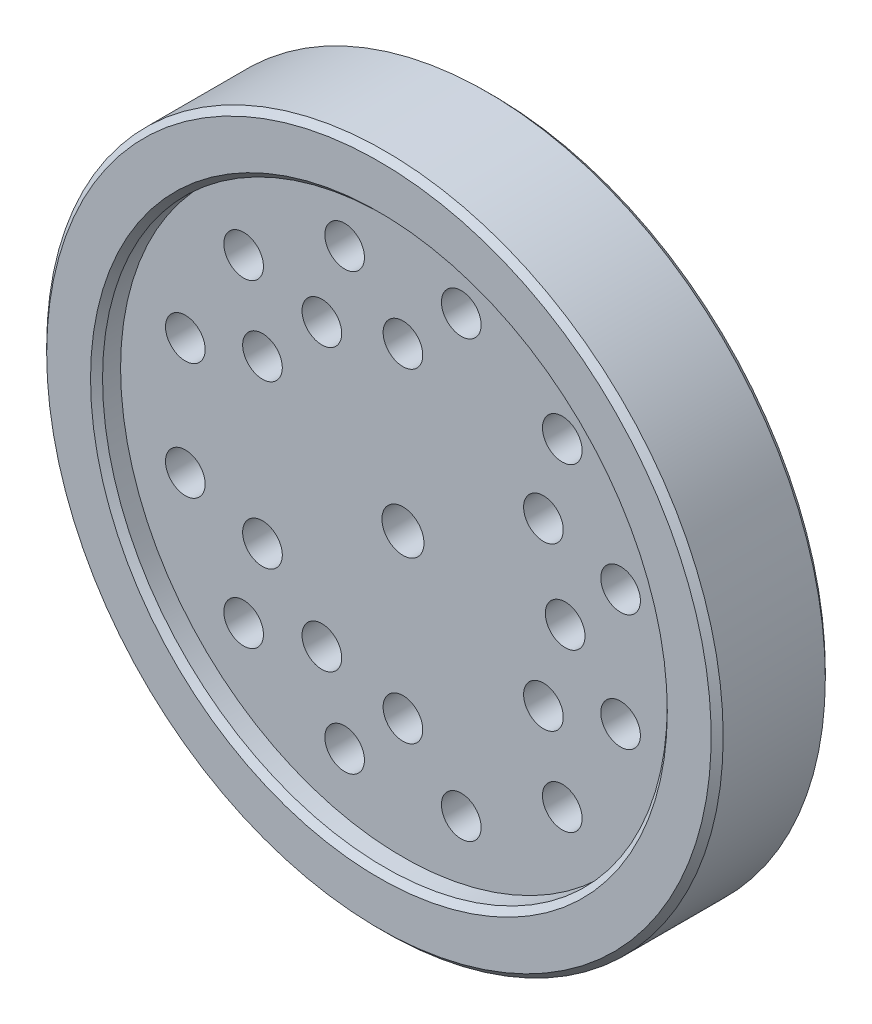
ISO-10303-21;
HEADER;
FILE_DESCRIPTION(('STEP AP214'),'2;1');
FILE_NAME('part.step','',(''),(''),'','','');
FILE_SCHEMA(('AUTOMOTIVE_DESIGN { 1 0 10303 214 1 1 1 1 }'));
ENDSEC;
DATA;
#1=APPLICATION_CONTEXT('core data for automotive mechanical design processes');
#2=APPLICATION_PROTOCOL_DEFINITION('international standard','automotive_design',2000,#1);
#3=PRODUCT_CONTEXT('',#1,'mechanical');
#4=PRODUCT('Part','Part','',(#3));
#5=PRODUCT_RELATED_PRODUCT_CATEGORY('part','',(#4));
#6=PRODUCT_DEFINITION_FORMATION('','',#4);
#7=PRODUCT_DEFINITION_CONTEXT('part definition',#1,'design');
#8=PRODUCT_DEFINITION('design','',#6,#7);
#9=PRODUCT_DEFINITION_SHAPE('','',#8);
#10=(LENGTH_UNIT() NAMED_UNIT(*) SI_UNIT(.MILLI.,.METRE.));
#11=(NAMED_UNIT(*) PLANE_ANGLE_UNIT() SI_UNIT($,.RADIAN.));
#12=(NAMED_UNIT(*) SI_UNIT($,.STERADIAN.) SOLID_ANGLE_UNIT());
#13=UNCERTAINTY_MEASURE_WITH_UNIT(LENGTH_MEASURE(1.E-05),#10,'distance_accuracy_value','');
#14=(GEOMETRIC_REPRESENTATION_CONTEXT(3) GLOBAL_UNCERTAINTY_ASSIGNED_CONTEXT((#13)) GLOBAL_UNIT_ASSIGNED_CONTEXT((#10,
#11,#12)) REPRESENTATION_CONTEXT('',''));
#15=CARTESIAN_POINT('',(0.,0.,0.));
#16=DIRECTION('',(0.,0.,1.));
#17=DIRECTION('',(1.,0.,0.));
#18=AXIS2_PLACEMENT_3D('',#15,#16,#17);
#19=CARTESIAN_POINT('',(1005.00000742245,-2.60902410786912E-12,1179.93308849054));
#20=DIRECTION('',(-7.55465713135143E-08,0.,0.999999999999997));
#21=DIRECTION('',(0.999999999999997,0.,7.55465713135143E-08));
#22=AXIS2_PLACEMENT_3D('',#19,#20,#21);
#23=CONICAL_SURFACE('',#22,48.0000000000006,0.78539816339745);
#24=CARTESIAN_POINT('',(1005.00000742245,-2.60902410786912E-12,1179.93308849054));
#25=DIRECTION('',(-7.55465713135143E-08,0.,0.999999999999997));
#26=DIRECTION('',(0.999999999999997,0.,7.55465713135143E-08));
#27=AXIS2_PLACEMENT_3D('',#24,#25,#26);
#28=CIRCLE('',#27,48.0000000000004);
#29=CARTESIAN_POINT('',(1053.00000742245,-2.60902410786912E-12,1179.93309211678));
#30=VERTEX_POINT('',#29);
#31=EDGE_CURVE('E20',#30,#30,#28,.T.);
#32=ORIENTED_EDGE('',*,*,#31,.T.);
#33=EDGE_LOOP('',(#32));
#34=FACE_BOUND('',#33,.T.);
#35=CARTESIAN_POINT('',(1005.000007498,-2.60787080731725E-12,1178.93308849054));
#36=DIRECTION('',(7.55465753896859E-08,0.,-0.999999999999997));
#37=DIRECTION('',(-0.999999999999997,0.,-7.55465753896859E-08));
#38=AXIS2_PLACEMENT_3D('',#35,#36,#37);
#39=CIRCLE('',#38,47.0000000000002);
#40=CARTESIAN_POINT('',(958.000007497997,-2.60787080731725E-12,1178.93308493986));
#41=VERTEX_POINT('',#40);
#42=EDGE_CURVE('E109',#41,#41,#39,.T.);
#43=ORIENTED_EDGE('',*,*,#42,.T.);
#44=EDGE_LOOP('',(#43));
#45=FACE_BOUND('',#44,.T.);
#46=ADVANCED_FACE('F17',(#34,#45),#23,.F.);
#47=CARTESIAN_POINT('',(1005.00000742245,-2.60902410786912E-12,1179.93308849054));
#48=DIRECTION('',(7.55465753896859E-08,0.,-0.999999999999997));
#49=DIRECTION('',(-0.999999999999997,0.,-7.55465753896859E-08));
#50=AXIS2_PLACEMENT_3D('',#47,#48,#49);
#51=CYLINDRICAL_SURFACE('',#50,47.0000000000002);
#52=ORIENTED_EDGE('',*,*,#42,.F.);
#53=EDGE_LOOP('',(#52));
#54=FACE_BOUND('',#53,.T.);
#55=CARTESIAN_POINT('',(1005.00000772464,-2.60441090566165E-12,1175.93308849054));
#56=DIRECTION('',(7.55465753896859E-08,0.,-0.999999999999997));
#57=DIRECTION('',(-0.999999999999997,0.,-7.55465753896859E-08));
#58=AXIS2_PLACEMENT_3D('',#55,#56,#57);
#59=CIRCLE('',#58,47.0000000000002);
#60=CARTESIAN_POINT('',(958.000007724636,-2.60441090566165E-12,1175.93308493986));
#61=VERTEX_POINT('',#60);
#62=EDGE_CURVE('E431',#61,#61,#59,.F.);
#63=ORIENTED_EDGE('',*,*,#62,.F.);
#64=EDGE_LOOP('',(#63));
#65=FACE_BOUND('',#64,.T.);
#66=ADVANCED_FACE('F444',(#54,#65),#51,.F.);
#67=CARTESIAN_POINT('',(1005.00000742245,-2.60902410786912E-12,1179.93308849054));
#68=DIRECTION('',(7.5546575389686E-08,0.,-0.999999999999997));
#69=DIRECTION('',(-0.999999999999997,0.,-7.5546575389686E-08));
#70=AXIS2_PLACEMENT_3D('',#67,#68,#69);
#71=PLANE('',#70);
#72=ORIENTED_EDGE('',*,*,#31,.F.);
#73=EDGE_LOOP('',(#72));
#74=FACE_BOUND('',#73,.T.);
#75=CARTESIAN_POINT('',(1005.00000742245,-2.60902410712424E-12,1179.93308849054));
#76=DIRECTION('',(7.55465790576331E-08,0.,-0.999999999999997));
#77=DIRECTION('',(-0.999999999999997,0.,-7.55465790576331E-08));
#78=AXIS2_PLACEMENT_3D('',#75,#76,#77);
#79=CIRCLE('',#78,55.3000000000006);
#80=CARTESIAN_POINT('',(949.700007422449,-2.60902410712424E-12,1179.93308431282));
#81=VERTEX_POINT('',#80);
#82=EDGE_CURVE('E375',#81,#81,#79,.T.);
#83=ORIENTED_EDGE('',*,*,#82,.F.);
#84=EDGE_LOOP('',(#83));
#85=FACE_BOUND('',#84,.T.);
#86=ADVANCED_FACE('F440',(#74,#85),#71,.F.);
#87=CARTESIAN_POINT('',(1005.00000772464,-2.60902410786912E-12,1175.93308849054));
#88=DIRECTION('',(-7.5546575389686E-08,0.,0.999999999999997));
#89=DIRECTION('',(0.999999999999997,0.,7.5546575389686E-08));
#90=AXIS2_PLACEMENT_3D('',#87,#88,#89);
#91=PLANE('',#90);
#92=CARTESIAN_POINT('',(1005.00000772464,-2.60902410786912E-12,1175.93308849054));
#93=DIRECTION('',(7.55465753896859E-08,0.,-0.999999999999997));
#94=DIRECTION('',(-0.999999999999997,0.,-7.55465753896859E-08));
#95=AXIS2_PLACEMENT_3D('',#92,#93,#94);
#96=CIRCLE('',#95,3.50000000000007);
#97=CARTESIAN_POINT('',(1001.50000772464,-2.60902410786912E-12,1175.93308822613));
#98=VERTEX_POINT('',#97);
#99=EDGE_CURVE('E372',#98,#98,#96,.T.);
#100=ORIENTED_EDGE('',*,*,#99,.T.);
#101=EDGE_LOOP('',(#100));
#102=FACE_BOUND('',#101,.T.);
#103=ORIENTED_EDGE('',*,*,#62,.T.);
#104=EDGE_LOOP('',(#103));
#105=FACE_BOUND('',#104,.T.);
#106=CARTESIAN_POINT('',(1031.51651201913,26.5165042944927,1175.93309049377));
#107=DIRECTION('',(7.55465753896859E-08,0.,-0.999999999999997));
#108=DIRECTION('',(-0.999999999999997,0.,-7.55465753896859E-08));
#109=AXIS2_PLACEMENT_3D('',#106,#107,#108);
#110=CIRCLE('',#109,3.30000000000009);
#111=CARTESIAN_POINT('',(1028.21651201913,26.5165042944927,1175.93309024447));
#112=VERTEX_POINT('',#111);
#113=EDGE_CURVE('E378',#112,#112,#110,.T.);
#114=ORIENTED_EDGE('',*,*,#113,.T.);
#115=EDGE_LOOP('',(#114));
#116=FACE_BOUND('',#115,.T.);
#117=CARTESIAN_POINT('',(1028.38269362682,13.4999999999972,1175.93309025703));
#118=DIRECTION('',(7.55465753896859E-08,0.,-0.999999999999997));
#119=DIRECTION('',(-0.999999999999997,0.,-7.55465753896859E-08));
#120=AXIS2_PLACEMENT_3D('',#117,#118,#119);
#121=CIRCLE('',#120,3.30000000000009);
#122=CARTESIAN_POINT('',(1025.08269362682,13.4999999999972,1175.93309000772));
#123=VERTEX_POINT('',#122);
#124=EDGE_CURVE('E381',#123,#123,#121,.T.);
#125=ORIENTED_EDGE('',*,*,#124,.T.);
#126=EDGE_LOOP('',(#125));
#127=FACE_BOUND('',#126,.T.);
#128=CARTESIAN_POINT('',(1041.22222621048,9.70571419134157,1175.93309122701));
#129=DIRECTION('',(7.55465753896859E-08,0.,-0.999999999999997));
#130=DIRECTION('',(-0.999999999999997,0.,-7.55465753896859E-08));
#131=AXIS2_PLACEMENT_3D('',#128,#129,#130);
#132=CIRCLE('',#131,3.30000000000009);
#133=CARTESIAN_POINT('',(1037.92222621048,9.70571419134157,1175.93309097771));
#134=VERTEX_POINT('',#133);
#135=EDGE_CURVE('E384',#134,#134,#132,.T.);
#136=ORIENTED_EDGE('',*,*,#135,.T.);
#137=EDGE_LOOP('',(#136));
#138=FACE_BOUND('',#137,.T.);
#139=CARTESIAN_POINT('',(1032.00000772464,-2.84836822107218E-12,1175.9330905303));
#140=DIRECTION('',(7.55465753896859E-08,0.,-0.999999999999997));
#141=DIRECTION('',(-0.999999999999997,0.,-7.55465753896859E-08));
#142=AXIS2_PLACEMENT_3D('',#139,#140,#141);
#143=CIRCLE('',#142,3.30000000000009);
#144=CARTESIAN_POINT('',(1028.70000772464,-2.84836822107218E-12,1175.933090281));
#145=VERTEX_POINT('',#144);
#146=EDGE_CURVE('E387',#145,#145,#143,.T.);
#147=ORIENTED_EDGE('',*,*,#146,.T.);
#148=EDGE_LOOP('',(#147));
#149=FACE_BOUND('',#148,.T.);
#150=CARTESIAN_POINT('',(1028.38269362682,-13.5000000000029,1175.93309025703));
#151=DIRECTION('',(7.55465753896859E-08,0.,-0.999999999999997));
#152=DIRECTION('',(-0.999999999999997,0.,-7.55465753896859E-08));
#153=AXIS2_PLACEMENT_3D('',#150,#151,#152);
#154=CIRCLE('',#153,3.30000000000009);
#155=CARTESIAN_POINT('',(1025.08269362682,-13.5000000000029,1175.93309000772));
#156=VERTEX_POINT('',#155);
#157=EDGE_CURVE('E390',#156,#156,#154,.T.);
#158=ORIENTED_EDGE('',*,*,#157,.T.);
#159=EDGE_LOOP('',(#158));
#160=FACE_BOUND('',#159,.T.);
#161=CARTESIAN_POINT('',(1031.51651201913,-26.5165042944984,1175.93309049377));
#162=DIRECTION('',(7.55465753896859E-08,0.,-0.999999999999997));
#163=DIRECTION('',(-0.999999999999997,0.,-7.55465753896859E-08));
#164=AXIS2_PLACEMENT_3D('',#161,#162,#163);
#165=CIRCLE('',#164,3.30000000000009);
#166=CARTESIAN_POINT('',(1028.21651201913,-26.5165042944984,1175.93309024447));
#167=VERTEX_POINT('',#166);
#168=EDGE_CURVE('E393',#167,#167,#165,.T.);
#169=ORIENTED_EDGE('',*,*,#168,.T.);
#170=EDGE_LOOP('',(#169));
#171=FACE_BOUND('',#170,.T.);
#172=CARTESIAN_POINT('',(1041.22222621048,-9.70571419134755,1175.93309122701));
#173=DIRECTION('',(7.55465753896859E-08,0.,-0.999999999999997));
#174=DIRECTION('',(-0.999999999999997,0.,-7.55465753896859E-08));
#175=AXIS2_PLACEMENT_3D('',#172,#173,#174);
#176=CIRCLE('',#175,3.30000000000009);
#177=CARTESIAN_POINT('',(1037.92222621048,-9.70571419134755,1175.93309097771));
#178=VERTEX_POINT('',#177);
#179=EDGE_CURVE('E396',#178,#178,#176,.T.);
#180=ORIENTED_EDGE('',*,*,#179,.T.);
#181=EDGE_LOOP('',(#180));
#182=FACE_BOUND('',#181,.T.);
#183=CARTESIAN_POINT('',(968.777789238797,9.70571419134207,1175.93308575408));
#184=DIRECTION('',(7.55465753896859E-08,0.,-0.999999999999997));
#185=DIRECTION('',(-0.999999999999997,0.,-7.55465753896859E-08));
#186=AXIS2_PLACEMENT_3D('',#183,#184,#185);
#187=CIRCLE('',#186,3.29999999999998);
#188=CARTESIAN_POINT('',(965.477789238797,9.70571419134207,1175.93308550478));
#189=VERTEX_POINT('',#188);
#190=EDGE_CURVE('E399',#189,#189,#187,.T.);
#191=ORIENTED_EDGE('',*,*,#190,.T.);
#192=EDGE_LOOP('',(#191));
#193=FACE_BOUND('',#192,.T.);
#194=CARTESIAN_POINT('',(981.617321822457,13.4999999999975,1175.93308672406));
#195=DIRECTION('',(7.55465753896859E-08,0.,-0.999999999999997));
#196=DIRECTION('',(-0.999999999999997,0.,-7.55465753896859E-08));
#197=AXIS2_PLACEMENT_3D('',#194,#195,#196);
#198=CIRCLE('',#197,3.29999999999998);
#199=CARTESIAN_POINT('',(978.317321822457,13.4999999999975,1175.93308647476));
#200=VERTEX_POINT('',#199);
#201=EDGE_CURVE('E402',#200,#200,#198,.T.);
#202=ORIENTED_EDGE('',*,*,#201,.T.);
#203=EDGE_LOOP('',(#202));
#204=FACE_BOUND('',#203,.T.);
#205=CARTESIAN_POINT('',(978.483503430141,26.5165042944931,1175.93308648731));
#206=DIRECTION('',(7.55465753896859E-08,0.,-0.999999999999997));
#207=DIRECTION('',(-0.999999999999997,0.,-7.55465753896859E-08));
#208=AXIS2_PLACEMENT_3D('',#205,#206,#207);
#209=CIRCLE('',#208,3.29999999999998);
#210=CARTESIAN_POINT('',(975.183503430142,26.5165042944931,1175.93308623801));
#211=VERTEX_POINT('',#210);
#212=EDGE_CURVE('E405',#211,#211,#209,.T.);
#213=ORIENTED_EDGE('',*,*,#212,.T.);
#214=EDGE_LOOP('',(#213));
#215=FACE_BOUND('',#214,.T.);
#216=CARTESIAN_POINT('',(991.500007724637,23.3826859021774,1175.93308747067));
#217=DIRECTION('',(7.55465753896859E-08,0.,-0.999999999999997));
#218=DIRECTION('',(-0.999999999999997,0.,-7.55465753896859E-08));
#219=AXIS2_PLACEMENT_3D('',#216,#217,#218);
#220=CIRCLE('',#219,3.29999999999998);
#221=CARTESIAN_POINT('',(988.200007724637,23.3826859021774,1175.93308722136));
#222=VERTEX_POINT('',#221);
#223=EDGE_CURVE('E408',#222,#222,#220,.T.);
#224=ORIENTED_EDGE('',*,*,#223,.T.);
#225=EDGE_LOOP('',(#224));
#226=FACE_BOUND('',#225,.T.);
#227=CARTESIAN_POINT('',(1005.00000772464,26.9999999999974,1175.93308849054));
#228=DIRECTION('',(7.55465753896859E-08,0.,-0.999999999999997));
#229=DIRECTION('',(-0.999999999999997,0.,-7.55465753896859E-08));
#230=AXIS2_PLACEMENT_3D('',#227,#228,#229);
#231=CIRCLE('',#230,3.30000000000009);
#232=CARTESIAN_POINT('',(1001.70000772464,26.9999999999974,1175.93308824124));
#233=VERTEX_POINT('',#232);
#234=EDGE_CURVE('E411',#233,#233,#231,.T.);
#235=ORIENTED_EDGE('',*,*,#234,.T.);
#236=EDGE_LOOP('',(#235));
#237=FACE_BOUND('',#236,.T.);
#238=CARTESIAN_POINT('',(1014.70572191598,36.2222184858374,1175.93308922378));
#239=DIRECTION('',(7.55465753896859E-08,0.,-0.999999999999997));
#240=DIRECTION('',(-0.999999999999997,0.,-7.55465753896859E-08));
#241=AXIS2_PLACEMENT_3D('',#238,#239,#240);
#242=CIRCLE('',#241,3.30000000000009);
#243=CARTESIAN_POINT('',(1011.40572191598,36.2222184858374,1175.93308897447));
#244=VERTEX_POINT('',#243);
#245=EDGE_CURVE('E414',#244,#244,#242,.T.);
#246=ORIENTED_EDGE('',*,*,#245,.T.);
#247=EDGE_LOOP('',(#246));
#248=FACE_BOUND('',#247,.T.);
#249=CARTESIAN_POINT('',(995.294293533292,36.2222184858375,1175.93308775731));
#250=DIRECTION('',(7.55465753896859E-08,0.,-0.999999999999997));
#251=DIRECTION('',(-0.999999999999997,0.,-7.55465753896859E-08));
#252=AXIS2_PLACEMENT_3D('',#249,#250,#251);
#253=CIRCLE('',#252,3.29999999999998);
#254=CARTESIAN_POINT('',(991.994293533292,36.2222184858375,1175.93308750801));
#255=VERTEX_POINT('',#254);
#256=EDGE_CURVE('E417',#255,#255,#253,.T.);
#257=ORIENTED_EDGE('',*,*,#256,.T.);
#258=EDGE_LOOP('',(#257));
#259=FACE_BOUND('',#258,.T.);
#260=CARTESIAN_POINT('',(1014.70572191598,-36.2222184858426,1175.93308922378));
#261=DIRECTION('',(7.55465753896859E-08,0.,-0.999999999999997));
#262=DIRECTION('',(-0.999999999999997,0.,-7.55465753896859E-08));
#263=AXIS2_PLACEMENT_3D('',#260,#261,#262);
#264=CIRCLE('',#263,3.30000000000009);
#265=CARTESIAN_POINT('',(1011.40572191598,-36.2222184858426,1175.93308897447));
#266=VERTEX_POINT('',#265);
#267=EDGE_CURVE('E420',#266,#266,#264,.T.);
#268=ORIENTED_EDGE('',*,*,#267,.T.);
#269=EDGE_LOOP('',(#268));
#270=FACE_BOUND('',#269,.T.);
#271=CARTESIAN_POINT('',(1005.00000772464,-27.0000000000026,1175.93308849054));
#272=DIRECTION('',(7.55465753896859E-08,0.,-0.999999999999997));
#273=DIRECTION('',(-0.999999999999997,0.,-7.55465753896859E-08));
#274=AXIS2_PLACEMENT_3D('',#271,#272,#273);
#275=CIRCLE('',#274,3.30000000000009);
#276=CARTESIAN_POINT('',(1001.70000772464,-27.0000000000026,1175.93308824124));
#277=VERTEX_POINT('',#276);
#278=EDGE_CURVE('E423',#277,#277,#275,.T.);
#279=ORIENTED_EDGE('',*,*,#278,.T.);
#280=EDGE_LOOP('',(#279));
#281=FACE_BOUND('',#280,.T.);
#282=CARTESIAN_POINT('',(995.294293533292,-36.2222184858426,1175.93308775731));
#283=DIRECTION('',(7.55465753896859E-08,0.,-0.999999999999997));
#284=DIRECTION('',(-0.999999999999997,0.,-7.55465753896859E-08));
#285=AXIS2_PLACEMENT_3D('',#282,#283,#284);
#286=CIRCLE('',#285,3.29999999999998);
#287=CARTESIAN_POINT('',(991.994293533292,-36.2222184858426,1175.93308750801));
#288=VERTEX_POINT('',#287);
#289=EDGE_CURVE('E426',#288,#288,#286,.T.);
#290=ORIENTED_EDGE('',*,*,#289,.T.);
#291=EDGE_LOOP('',(#290));
#292=FACE_BOUND('',#291,.T.);
#293=CARTESIAN_POINT('',(991.500007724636,-23.3826859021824,1175.93308747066));
#294=DIRECTION('',(7.55465753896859E-08,0.,-0.999999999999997));
#295=DIRECTION('',(-0.999999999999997,0.,-7.55465753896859E-08));
#296=AXIS2_PLACEMENT_3D('',#293,#294,#295);
#297=CIRCLE('',#296,3.29999999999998);
#298=CARTESIAN_POINT('',(988.200007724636,-23.3826859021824,1175.93308722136));
#299=VERTEX_POINT('',#298);
#300=EDGE_CURVE('E369',#299,#299,#297,.T.);
#301=ORIENTED_EDGE('',*,*,#300,.T.);
#302=EDGE_LOOP('',(#301));
#303=FACE_BOUND('',#302,.T.);
#304=CARTESIAN_POINT('',(981.617321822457,-13.5000000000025,1175.93308672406));
#305=DIRECTION('',(7.55465753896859E-08,0.,-0.999999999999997));
#306=DIRECTION('',(-0.999999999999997,0.,-7.55465753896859E-08));
#307=AXIS2_PLACEMENT_3D('',#304,#305,#306);
#308=CIRCLE('',#307,3.29999999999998);
#309=CARTESIAN_POINT('',(978.317321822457,-13.5000000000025,1175.93308647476));
#310=VERTEX_POINT('',#309);
#311=EDGE_CURVE('E366',#310,#310,#308,.T.);
#312=ORIENTED_EDGE('',*,*,#311,.T.);
#313=EDGE_LOOP('',(#312));
#314=FACE_BOUND('',#313,.T.);
#315=CARTESIAN_POINT('',(968.777789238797,-9.70571419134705,1175.93308575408));
#316=DIRECTION('',(7.55465753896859E-08,0.,-0.999999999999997));
#317=DIRECTION('',(-0.999999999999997,0.,-7.55465753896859E-08));
#318=AXIS2_PLACEMENT_3D('',#315,#316,#317);
#319=CIRCLE('',#318,3.29999999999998);
#320=CARTESIAN_POINT('',(965.477789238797,-9.70571419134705,1175.93308550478));
#321=VERTEX_POINT('',#320);
#322=EDGE_CURVE('E429',#321,#321,#319,.T.);
#323=ORIENTED_EDGE('',*,*,#322,.T.);
#324=EDGE_LOOP('',(#323));
#325=FACE_BOUND('',#324,.T.);
#326=CARTESIAN_POINT('',(978.483503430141,-26.516504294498,1175.93308648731));
#327=DIRECTION('',(7.55465753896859E-08,0.,-0.999999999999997));
#328=DIRECTION('',(-0.999999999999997,0.,-7.55465753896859E-08));
#329=AXIS2_PLACEMENT_3D('',#326,#327,#328);
#330=CIRCLE('',#329,3.29999999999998);
#331=CARTESIAN_POINT('',(975.183503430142,-26.516504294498,1175.93308623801));
#332=VERTEX_POINT('',#331);
#333=EDGE_CURVE('E363',#332,#332,#330,.T.);
#334=ORIENTED_EDGE('',*,*,#333,.T.);
#335=EDGE_LOOP('',(#334));
#336=FACE_BOUND('',#335,.T.);
#337=ADVANCED_FACE('F443',(#102,#105,#116,#127,#138,#149,#160,#171,#182,#193,#204,#215,#226,
#237,#248,#259,#270,#281,#292,#303,#314,#325,#336),#91,.T.);
#338=CARTESIAN_POINT('',(1054.03927212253,9.75451610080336,1170.93309219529));
#339=DIRECTION('',(7.5546575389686E-08,0.,-0.999999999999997));
#340=DIRECTION('',(-0.999999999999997,0.,-7.5546575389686E-08));
#341=AXIS2_PLACEMENT_3D('',#338,#339,#340);
#342=PLANE('',#341);
#343=CARTESIAN_POINT('',(1054.03927212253,9.75451610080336,1170.93309219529));
#344=DIRECTION('',(7.55465753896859E-08,0.,-0.999999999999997));
#345=DIRECTION('',(-0.999999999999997,0.,-7.55465753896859E-08));
#346=AXIS2_PLACEMENT_3D('',#343,#344,#345);
#347=CIRCLE('',#346,2.49999999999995);
#348=CARTESIAN_POINT('',(1051.53927212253,9.75451610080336,1170.93309200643));
#349=VERTEX_POINT('',#348);
#350=EDGE_CURVE('E360',#349,#349,#347,.T.);
#351=ORIENTED_EDGE('',*,*,#350,.T.);
#352=EDGE_LOOP('',(#351));
#353=FACE_BOUND('',#352,.T.);
#354=ADVANCED_FACE('F582',(#353),#342,.T.);
#355=CARTESIAN_POINT('',(955.960744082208,-9.75451610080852,1170.9330847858));
#356=DIRECTION('',(-7.5546575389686E-08,0.,0.999999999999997));
#357=DIRECTION('',(0.999999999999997,0.,7.5546575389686E-08));
#358=AXIS2_PLACEMENT_3D('',#355,#356,#357);
#359=PLANE('',#358);
#360=CARTESIAN_POINT('',(955.960744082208,-9.75451610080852,1170.9330847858));
#361=DIRECTION('',(7.55465753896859E-08,0.,-0.999999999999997));
#362=DIRECTION('',(-0.999999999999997,0.,-7.55465753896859E-08));
#363=AXIS2_PLACEMENT_3D('',#360,#361,#362);
#364=CIRCLE('',#363,2.49999999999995);
#365=CARTESIAN_POINT('',(953.460744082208,-9.75451610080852,1170.93308459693));
#366=VERTEX_POINT('',#365);
#367=EDGE_CURVE('E357',#366,#366,#364,.T.);
#368=ORIENTED_EDGE('',*,*,#367,.T.);
#369=EDGE_LOOP('',(#368));
#370=FACE_BOUND('',#369,.T.);
#371=ADVANCED_FACE('F584',(#370),#359,.F.);
#372=CARTESIAN_POINT('',(968.777790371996,-9.70571419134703,1160.93308575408));
#373=DIRECTION('',(7.55465753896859E-08,0.,-0.999999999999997));
#374=DIRECTION('',(-0.999999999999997,0.,-7.55465753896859E-08));
#375=AXIS2_PLACEMENT_3D('',#372,#373,#374);
#376=CYLINDRICAL_SURFACE('',#375,3.29999999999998);
#377=ORIENTED_EDGE('',*,*,#322,.F.);
#378=EDGE_LOOP('',(#377));
#379=FACE_BOUND('',#378,.T.);
#380=CARTESIAN_POINT('',(968.77778972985,-9.70571419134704,1169.43308575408));
#381=DIRECTION('',(7.55465753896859E-08,0.,-0.999999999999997));
#382=DIRECTION('',(-0.999999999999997,0.,-7.55465753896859E-08));
#383=AXIS2_PLACEMENT_3D('',#380,#381,#382);
#384=CIRCLE('',#383,3.29999999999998);
#385=CARTESIAN_POINT('',(965.47778972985,-9.70571419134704,1169.43308550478));
#386=VERTEX_POINT('',#385);
#387=EDGE_CURVE('E354',#386,#386,#384,.T.);
#388=ORIENTED_EDGE('',*,*,#387,.T.);
#389=EDGE_LOOP('',(#388));
#390=FACE_BOUND('',#389,.T.);
#391=ADVANCED_FACE('F591',(#379,#390),#376,.F.);
#392=CARTESIAN_POINT('',(995.294294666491,-36.2222184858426,1160.93308775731));
#393=DIRECTION('',(7.55465753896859E-08,0.,-0.999999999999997));
#394=DIRECTION('',(-0.999999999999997,0.,-7.55465753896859E-08));
#395=AXIS2_PLACEMENT_3D('',#392,#393,#394);
#396=CYLINDRICAL_SURFACE('',#395,3.29999999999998);
#397=ORIENTED_EDGE('',*,*,#289,.F.);
#398=EDGE_LOOP('',(#397));
#399=FACE_BOUND('',#398,.T.);
#400=CARTESIAN_POINT('',(995.294294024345,-36.2222184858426,1169.43308775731));
#401=DIRECTION('',(7.55465753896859E-08,0.,-0.999999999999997));
#402=DIRECTION('',(-0.999999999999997,0.,-7.55465753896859E-08));
#403=AXIS2_PLACEMENT_3D('',#400,#401,#402);
#404=CIRCLE('',#403,3.29999999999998);
#405=CARTESIAN_POINT('',(991.994294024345,-36.2222184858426,1169.43308750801));
#406=VERTEX_POINT('',#405);
#407=EDGE_CURVE('E351',#406,#406,#404,.T.);
#408=ORIENTED_EDGE('',*,*,#407,.T.);
#409=EDGE_LOOP('',(#408));
#410=FACE_BOUND('',#409,.T.);
#411=ADVANCED_FACE('F646',(#399,#410),#396,.F.);
#412=CARTESIAN_POINT('',(1005.00000885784,-27.0000000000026,1160.93308849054));
#413=DIRECTION('',(7.55465753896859E-08,0.,-0.999999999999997));
#414=DIRECTION('',(-0.999999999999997,0.,-7.55465753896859E-08));
#415=AXIS2_PLACEMENT_3D('',#412,#413,#414);
#416=CYLINDRICAL_SURFACE('',#415,3.30000000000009);
#417=ORIENTED_EDGE('',*,*,#278,.F.);
#418=EDGE_LOOP('',(#417));
#419=FACE_BOUND('',#418,.T.);
#420=CARTESIAN_POINT('',(1005.00000821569,-27.0000000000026,1169.43308849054));
#421=DIRECTION('',(7.55465753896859E-08,0.,-0.999999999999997));
#422=DIRECTION('',(-0.999999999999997,0.,-7.55465753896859E-08));
#423=AXIS2_PLACEMENT_3D('',#420,#421,#422);
#424=CIRCLE('',#423,3.30000000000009);
#425=CARTESIAN_POINT('',(1001.70000821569,-27.0000000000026,1169.43308824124));
#426=VERTEX_POINT('',#425);
#427=EDGE_CURVE('E348',#426,#426,#424,.T.);
#428=ORIENTED_EDGE('',*,*,#427,.T.);
#429=EDGE_LOOP('',(#428));
#430=FACE_BOUND('',#429,.T.);
#431=ADVANCED_FACE('F656',(#419,#430),#416,.F.);
#432=CARTESIAN_POINT('',(1014.70572304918,-36.2222184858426,1160.93308922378));
#433=DIRECTION('',(7.55465753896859E-08,0.,-0.999999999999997));
#434=DIRECTION('',(-0.999999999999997,0.,-7.55465753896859E-08));
#435=AXIS2_PLACEMENT_3D('',#432,#433,#434);
#436=CYLINDRICAL_SURFACE('',#435,3.30000000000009);
#437=ORIENTED_EDGE('',*,*,#267,.F.);
#438=EDGE_LOOP('',(#437));
#439=FACE_BOUND('',#438,.T.);
#440=CARTESIAN_POINT('',(1014.70572240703,-36.2222184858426,1169.43308922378));
#441=DIRECTION('',(7.55465753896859E-08,0.,-0.999999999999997));
#442=DIRECTION('',(-0.999999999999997,0.,-7.55465753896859E-08));
#443=AXIS2_PLACEMENT_3D('',#440,#441,#442);
#444=CIRCLE('',#443,3.30000000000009);
#445=CARTESIAN_POINT('',(1011.40572240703,-36.2222184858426,1169.43308897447));
#446=VERTEX_POINT('',#445);
#447=EDGE_CURVE('E345',#446,#446,#444,.T.);
#448=ORIENTED_EDGE('',*,*,#447,.T.);
#449=EDGE_LOOP('',(#448));
#450=FACE_BOUND('',#449,.T.);
#451=ADVANCED_FACE('F668',(#439,#450),#436,.F.);
#452=CARTESIAN_POINT('',(995.294294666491,36.2222184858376,1160.93308775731));
#453=DIRECTION('',(7.55465753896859E-08,0.,-0.999999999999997));
#454=DIRECTION('',(-0.999999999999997,0.,-7.55465753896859E-08));
#455=AXIS2_PLACEMENT_3D('',#452,#453,#454);
#456=CYLINDRICAL_SURFACE('',#455,3.29999999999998);
#457=ORIENTED_EDGE('',*,*,#256,.F.);
#458=EDGE_LOOP('',(#457));
#459=FACE_BOUND('',#458,.T.);
#460=CARTESIAN_POINT('',(995.294294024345,36.2222184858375,1169.43308775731));
#461=DIRECTION('',(7.55465753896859E-08,0.,-0.999999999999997));
#462=DIRECTION('',(-0.999999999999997,0.,-7.55465753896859E-08));
#463=AXIS2_PLACEMENT_3D('',#460,#461,#462);
#464=CIRCLE('',#463,3.29999999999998);
#465=CARTESIAN_POINT('',(991.994294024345,36.2222184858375,1169.43308750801));
#466=VERTEX_POINT('',#465);
#467=EDGE_CURVE('E342',#466,#466,#464,.T.);
#468=ORIENTED_EDGE('',*,*,#467,.T.);
#469=EDGE_LOOP('',(#468));
#470=FACE_BOUND('',#469,.T.);
#471=ADVANCED_FACE('F678',(#459,#470),#456,.F.);
#472=CARTESIAN_POINT('',(1014.70572304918,36.2222184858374,1160.93308922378));
#473=DIRECTION('',(7.55465753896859E-08,0.,-0.999999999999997));
#474=DIRECTION('',(-0.999999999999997,0.,-7.55465753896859E-08));
#475=AXIS2_PLACEMENT_3D('',#472,#473,#474);
#476=CYLINDRICAL_SURFACE('',#475,3.30000000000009);
#477=ORIENTED_EDGE('',*,*,#245,.F.);
#478=EDGE_LOOP('',(#477));
#479=FACE_BOUND('',#478,.T.);
#480=CARTESIAN_POINT('',(1014.70572240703,36.2222184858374,1169.43308922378));
#481=DIRECTION('',(7.55465753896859E-08,0.,-0.999999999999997));
#482=DIRECTION('',(-0.999999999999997,0.,-7.55465753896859E-08));
#483=AXIS2_PLACEMENT_3D('',#480,#481,#482);
#484=CIRCLE('',#483,3.30000000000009);
#485=CARTESIAN_POINT('',(1011.40572240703,36.2222184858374,1169.43308897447));
#486=VERTEX_POINT('',#485);
#487=EDGE_CURVE('E339',#486,#486,#484,.T.);
#488=ORIENTED_EDGE('',*,*,#487,.T.);
#489=EDGE_LOOP('',(#488));
#490=FACE_BOUND('',#489,.T.);
#491=ADVANCED_FACE('F689',(#479,#490),#476,.F.);
#492=CARTESIAN_POINT('',(1005.00000885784,26.9999999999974,1160.93308849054));
#493=DIRECTION('',(7.55465753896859E-08,0.,-0.999999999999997));
#494=DIRECTION('',(-0.999999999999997,0.,-7.55465753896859E-08));
#495=AXIS2_PLACEMENT_3D('',#492,#493,#494);
#496=CYLINDRICAL_SURFACE('',#495,3.30000000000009);
#497=ORIENTED_EDGE('',*,*,#234,.F.);
#498=EDGE_LOOP('',(#497));
#499=FACE_BOUND('',#498,.T.);
#500=CARTESIAN_POINT('',(1005.00000821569,26.9999999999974,1169.43308849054));
#501=DIRECTION('',(7.55465753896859E-08,0.,-0.999999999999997));
#502=DIRECTION('',(-0.999999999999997,0.,-7.55465753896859E-08));
#503=AXIS2_PLACEMENT_3D('',#500,#501,#502);
#504=CIRCLE('',#503,3.30000000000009);
#505=CARTESIAN_POINT('',(1001.70000821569,26.9999999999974,1169.43308824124));
#506=VERTEX_POINT('',#505);
#507=EDGE_CURVE('E336',#506,#506,#504,.T.);
#508=ORIENTED_EDGE('',*,*,#507,.T.);
#509=EDGE_LOOP('',(#508));
#510=FACE_BOUND('',#509,.T.);
#511=ADVANCED_FACE('F699',(#499,#510),#496,.F.);
#512=CARTESIAN_POINT('',(991.500008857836,23.3826859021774,1160.93308747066));
#513=DIRECTION('',(7.55465753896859E-08,0.,-0.999999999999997));
#514=DIRECTION('',(-0.999999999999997,0.,-7.55465753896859E-08));
#515=AXIS2_PLACEMENT_3D('',#512,#513,#514);
#516=CYLINDRICAL_SURFACE('',#515,3.29999999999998);
#517=ORIENTED_EDGE('',*,*,#223,.F.);
#518=EDGE_LOOP('',(#517));
#519=FACE_BOUND('',#518,.T.);
#520=CARTESIAN_POINT('',(991.50000821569,23.3826859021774,1169.43308747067));
#521=DIRECTION('',(7.55465753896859E-08,0.,-0.999999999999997));
#522=DIRECTION('',(-0.999999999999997,0.,-7.55465753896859E-08));
#523=AXIS2_PLACEMENT_3D('',#520,#521,#522);
#524=CIRCLE('',#523,3.29999999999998);
#525=CARTESIAN_POINT('',(988.20000821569,23.3826859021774,1169.43308722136));
#526=VERTEX_POINT('',#525);
#527=EDGE_CURVE('E333',#526,#526,#524,.T.);
#528=ORIENTED_EDGE('',*,*,#527,.T.);
#529=EDGE_LOOP('',(#528));
#530=FACE_BOUND('',#529,.T.);
#531=ADVANCED_FACE('F710',(#519,#530),#516,.F.);
#532=CARTESIAN_POINT('',(978.48350456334,26.5165042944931,1160.93308648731));
#533=DIRECTION('',(7.55465753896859E-08,0.,-0.999999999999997));
#534=DIRECTION('',(-0.999999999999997,0.,-7.55465753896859E-08));
#535=AXIS2_PLACEMENT_3D('',#532,#533,#534);
#536=CYLINDRICAL_SURFACE('',#535,3.29999999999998);
#537=ORIENTED_EDGE('',*,*,#212,.F.);
#538=EDGE_LOOP('',(#537));
#539=FACE_BOUND('',#538,.T.);
#540=CARTESIAN_POINT('',(978.483503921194,26.5165042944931,1169.43308648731));
#541=DIRECTION('',(7.55465753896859E-08,0.,-0.999999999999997));
#542=DIRECTION('',(-0.999999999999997,0.,-7.55465753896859E-08));
#543=AXIS2_PLACEMENT_3D('',#540,#541,#542);
#544=CIRCLE('',#543,3.29999999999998);
#545=CARTESIAN_POINT('',(975.183503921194,26.5165042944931,1169.43308623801));
#546=VERTEX_POINT('',#545);
#547=EDGE_CURVE('E330',#546,#546,#544,.T.);
#548=ORIENTED_EDGE('',*,*,#547,.T.);
#549=EDGE_LOOP('',(#548));
#550=FACE_BOUND('',#549,.T.);
#551=ADVANCED_FACE('F720',(#539,#550),#536,.F.);
#552=CARTESIAN_POINT('',(981.617322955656,13.4999999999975,1160.93308672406));
#553=DIRECTION('',(7.55465753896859E-08,0.,-0.999999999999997));
#554=DIRECTION('',(-0.999999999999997,0.,-7.55465753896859E-08));
#555=AXIS2_PLACEMENT_3D('',#552,#553,#554);
#556=CYLINDRICAL_SURFACE('',#555,3.29999999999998);
#557=ORIENTED_EDGE('',*,*,#201,.F.);
#558=EDGE_LOOP('',(#557));
#559=FACE_BOUND('',#558,.T.);
#560=CARTESIAN_POINT('',(981.61732231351,13.4999999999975,1169.43308672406));
#561=DIRECTION('',(7.55465753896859E-08,0.,-0.999999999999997));
#562=DIRECTION('',(-0.999999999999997,0.,-7.55465753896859E-08));
#563=AXIS2_PLACEMENT_3D('',#560,#561,#562);
#564=CIRCLE('',#563,3.29999999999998);
#565=CARTESIAN_POINT('',(978.31732231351,13.4999999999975,1169.43308647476));
#566=VERTEX_POINT('',#565);
#567=EDGE_CURVE('E327',#566,#566,#564,.T.);
#568=ORIENTED_EDGE('',*,*,#567,.T.);
#569=EDGE_LOOP('',(#568));
#570=FACE_BOUND('',#569,.T.);
#571=ADVANCED_FACE('F730',(#559,#570),#556,.F.);
#572=CARTESIAN_POINT('',(968.777790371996,9.70571419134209,1160.93308575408));
#573=DIRECTION('',(7.55465753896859E-08,0.,-0.999999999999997));
#574=DIRECTION('',(-0.999999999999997,0.,-7.55465753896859E-08));
#575=AXIS2_PLACEMENT_3D('',#572,#573,#574);
#576=CYLINDRICAL_SURFACE('',#575,3.29999999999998);
#577=ORIENTED_EDGE('',*,*,#190,.F.);
#578=EDGE_LOOP('',(#577));
#579=FACE_BOUND('',#578,.T.);
#580=CARTESIAN_POINT('',(968.77778972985,9.70571419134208,1169.43308575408));
#581=DIRECTION('',(7.55465753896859E-08,0.,-0.999999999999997));
#582=DIRECTION('',(-0.999999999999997,0.,-7.55465753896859E-08));
#583=AXIS2_PLACEMENT_3D('',#580,#581,#582);
#584=CIRCLE('',#583,3.29999999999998);
#585=CARTESIAN_POINT('',(965.47778972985,9.70571419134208,1169.43308550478));
#586=VERTEX_POINT('',#585);
#587=EDGE_CURVE('E324',#586,#586,#584,.T.);
#588=ORIENTED_EDGE('',*,*,#587,.T.);
#589=EDGE_LOOP('',(#588));
#590=FACE_BOUND('',#589,.T.);
#591=ADVANCED_FACE('F740',(#579,#590),#576,.F.);
#592=CARTESIAN_POINT('',(1041.22222734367,-9.70571419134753,1160.93309122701));
#593=DIRECTION('',(7.55465753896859E-08,0.,-0.999999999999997));
#594=DIRECTION('',(-0.999999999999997,0.,-7.55465753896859E-08));
#595=AXIS2_PLACEMENT_3D('',#592,#593,#594);
#596=CYLINDRICAL_SURFACE('',#595,3.30000000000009);
#597=ORIENTED_EDGE('',*,*,#179,.F.);
#598=EDGE_LOOP('',(#597));
#599=FACE_BOUND('',#598,.T.);
#600=CARTESIAN_POINT('',(1041.22222670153,-9.70571419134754,1169.43309122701));
#601=DIRECTION('',(7.55465753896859E-08,0.,-0.999999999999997));
#602=DIRECTION('',(-0.999999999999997,0.,-7.55465753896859E-08));
#603=AXIS2_PLACEMENT_3D('',#600,#601,#602);
#604=CIRCLE('',#603,3.30000000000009);
#605=CARTESIAN_POINT('',(1037.92222670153,-9.70571419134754,1169.43309097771));
#606=VERTEX_POINT('',#605);
#607=EDGE_CURVE('E321',#606,#606,#604,.T.);
#608=ORIENTED_EDGE('',*,*,#607,.T.);
#609=EDGE_LOOP('',(#608));
#610=FACE_BOUND('',#609,.T.);
#611=ADVANCED_FACE('F751',(#599,#610),#596,.F.);
#612=CARTESIAN_POINT('',(1031.51651315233,-26.5165042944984,1160.93309049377));
#613=DIRECTION('',(7.55465753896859E-08,0.,-0.999999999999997));
#614=DIRECTION('',(-0.999999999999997,0.,-7.55465753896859E-08));
#615=AXIS2_PLACEMENT_3D('',#612,#613,#614);
#616=CYLINDRICAL_SURFACE('',#615,3.30000000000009);
#617=ORIENTED_EDGE('',*,*,#168,.F.);
#618=EDGE_LOOP('',(#617));
#619=FACE_BOUND('',#618,.T.);
#620=CARTESIAN_POINT('',(1031.51651251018,-26.5165042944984,1169.43309049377));
#621=DIRECTION('',(7.55465753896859E-08,0.,-0.999999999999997));
#622=DIRECTION('',(-0.999999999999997,0.,-7.55465753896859E-08));
#623=AXIS2_PLACEMENT_3D('',#620,#621,#622);
#624=CIRCLE('',#623,3.30000000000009);
#625=CARTESIAN_POINT('',(1028.21651251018,-26.5165042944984,1169.43309024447));
#626=VERTEX_POINT('',#625);
#627=EDGE_CURVE('E318',#626,#626,#624,.T.);
#628=ORIENTED_EDGE('',*,*,#627,.T.);
#629=EDGE_LOOP('',(#628));
#630=FACE_BOUND('',#629,.T.);
#631=ADVANCED_FACE('F761',(#619,#630),#616,.F.);
#632=CARTESIAN_POINT('',(1028.38269476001,-13.5000000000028,1160.93309025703));
#633=DIRECTION('',(7.55465753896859E-08,0.,-0.999999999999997));
#634=DIRECTION('',(-0.999999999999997,0.,-7.55465753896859E-08));
#635=AXIS2_PLACEMENT_3D('',#632,#633,#634);
#636=CYLINDRICAL_SURFACE('',#635,3.30000000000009);
#637=ORIENTED_EDGE('',*,*,#157,.F.);
#638=EDGE_LOOP('',(#637));
#639=FACE_BOUND('',#638,.T.);
#640=CARTESIAN_POINT('',(1028.38269411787,-13.5000000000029,1169.43309025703));
#641=DIRECTION('',(7.55465753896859E-08,0.,-0.999999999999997));
#642=DIRECTION('',(-0.999999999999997,0.,-7.55465753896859E-08));
#643=AXIS2_PLACEMENT_3D('',#640,#641,#642);
#644=CIRCLE('',#643,3.30000000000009);
#645=CARTESIAN_POINT('',(1025.08269411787,-13.5000000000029,1169.43309000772));
#646=VERTEX_POINT('',#645);
#647=EDGE_CURVE('E315',#646,#646,#644,.T.);
#648=ORIENTED_EDGE('',*,*,#647,.T.);
#649=EDGE_LOOP('',(#648));
#650=FACE_BOUND('',#649,.T.);
#651=ADVANCED_FACE('F771',(#639,#650),#636,.F.);
#652=CARTESIAN_POINT('',(1032.00000885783,-2.83106871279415E-12,1160.9330905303));
#653=DIRECTION('',(7.55465753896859E-08,0.,-0.999999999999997));
#654=DIRECTION('',(-0.999999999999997,0.,-7.55465753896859E-08));
#655=AXIS2_PLACEMENT_3D('',#652,#653,#654);
#656=CYLINDRICAL_SURFACE('',#655,3.30000000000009);
#657=ORIENTED_EDGE('',*,*,#146,.F.);
#658=EDGE_LOOP('',(#657));
#659=FACE_BOUND('',#658,.T.);
#660=CARTESIAN_POINT('',(1032.00000821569,-2.84087176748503E-12,1169.4330905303));
#661=DIRECTION('',(7.55465753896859E-08,0.,-0.999999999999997));
#662=DIRECTION('',(-0.999999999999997,0.,-7.55465753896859E-08));
#663=AXIS2_PLACEMENT_3D('',#660,#661,#662);
#664=CIRCLE('',#663,3.30000000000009);
#665=CARTESIAN_POINT('',(1028.70000821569,-2.84087176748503E-12,1169.433090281));
#666=VERTEX_POINT('',#665);
#667=EDGE_CURVE('E312',#666,#666,#664,.T.);
#668=ORIENTED_EDGE('',*,*,#667,.T.);
#669=EDGE_LOOP('',(#668));
#670=FACE_BOUND('',#669,.T.);
#671=ADVANCED_FACE('F781',(#659,#670),#656,.F.);
#672=CARTESIAN_POINT('',(1041.22222734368,9.70571419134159,1160.93309122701));
#673=DIRECTION('',(7.55465753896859E-08,0.,-0.999999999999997));
#674=DIRECTION('',(-0.999999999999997,0.,-7.55465753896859E-08));
#675=AXIS2_PLACEMENT_3D('',#672,#673,#674);
#676=CYLINDRICAL_SURFACE('',#675,3.30000000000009);
#677=ORIENTED_EDGE('',*,*,#135,.F.);
#678=EDGE_LOOP('',(#677));
#679=FACE_BOUND('',#678,.T.);
#680=CARTESIAN_POINT('',(1041.22222670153,9.70571419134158,1169.43309122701));
#681=DIRECTION('',(7.55465753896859E-08,0.,-0.999999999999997));
#682=DIRECTION('',(-0.999999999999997,0.,-7.55465753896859E-08));
#683=AXIS2_PLACEMENT_3D('',#680,#681,#682);
#684=CIRCLE('',#683,3.30000000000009);
#685=CARTESIAN_POINT('',(1037.92222670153,9.70571419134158,1169.43309097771));
#686=VERTEX_POINT('',#685);
#687=EDGE_CURVE('E309',#686,#686,#684,.T.);
#688=ORIENTED_EDGE('',*,*,#687,.T.);
#689=EDGE_LOOP('',(#688));
#690=FACE_BOUND('',#689,.T.);
#691=ADVANCED_FACE('F792',(#679,#690),#676,.F.);
#692=CARTESIAN_POINT('',(1028.38269476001,13.4999999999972,1160.93309025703));
#693=DIRECTION('',(7.55465753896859E-08,0.,-0.999999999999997));
#694=DIRECTION('',(-0.999999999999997,0.,-7.55465753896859E-08));
#695=AXIS2_PLACEMENT_3D('',#692,#693,#694);
#696=CYLINDRICAL_SURFACE('',#695,3.30000000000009);
#697=ORIENTED_EDGE('',*,*,#124,.F.);
#698=EDGE_LOOP('',(#697));
#699=FACE_BOUND('',#698,.T.);
#700=CARTESIAN_POINT('',(1028.38269411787,13.4999999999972,1169.43309025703));
#701=DIRECTION('',(7.55465753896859E-08,0.,-0.999999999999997));
#702=DIRECTION('',(-0.999999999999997,0.,-7.55465753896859E-08));
#703=AXIS2_PLACEMENT_3D('',#700,#701,#702);
#704=CIRCLE('',#703,3.30000000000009);
#705=CARTESIAN_POINT('',(1025.08269411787,13.4999999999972,1169.43309000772));
#706=VERTEX_POINT('',#705);
#707=EDGE_CURVE('E306',#706,#706,#704,.T.);
#708=ORIENTED_EDGE('',*,*,#707,.T.);
#709=EDGE_LOOP('',(#708));
#710=FACE_BOUND('',#709,.T.);
#711=ADVANCED_FACE('F802',(#699,#710),#696,.F.);
#712=CARTESIAN_POINT('',(1031.51651315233,26.5165042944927,1160.93309049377));
#713=DIRECTION('',(7.55465753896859E-08,0.,-0.999999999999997));
#714=DIRECTION('',(-0.999999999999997,0.,-7.55465753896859E-08));
#715=AXIS2_PLACEMENT_3D('',#712,#713,#714);
#716=CYLINDRICAL_SURFACE('',#715,3.30000000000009);
#717=ORIENTED_EDGE('',*,*,#113,.F.);
#718=EDGE_LOOP('',(#717));
#719=FACE_BOUND('',#718,.T.);
#720=CARTESIAN_POINT('',(1031.51651251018,26.5165042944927,1169.43309049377));
#721=DIRECTION('',(7.55465753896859E-08,0.,-0.999999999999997));
#722=DIRECTION('',(-0.999999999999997,0.,-7.55465753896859E-08));
#723=AXIS2_PLACEMENT_3D('',#720,#721,#722);
#724=CIRCLE('',#723,3.30000000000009);
#725=CARTESIAN_POINT('',(1028.21651251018,26.5165042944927,1169.43309024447));
#726=VERTEX_POINT('',#725);
#727=EDGE_CURVE('E108',#726,#726,#724,.T.);
#728=ORIENTED_EDGE('',*,*,#727,.T.);
#729=EDGE_LOOP('',(#728));
#730=FACE_BOUND('',#729,.T.);
#731=ADVANCED_FACE('F452',(#719,#730),#716,.F.);
#732=CARTESIAN_POINT('',(1005.000007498,-2.60902410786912E-12,1178.93308849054));
#733=DIRECTION('',(7.55465790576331E-08,0.,-0.999999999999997));
#734=DIRECTION('',(-0.999999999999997,0.,-7.55465790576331E-08));
#735=AXIS2_PLACEMENT_3D('',#732,#733,#734);
#736=CONICAL_SURFACE('',#735,56.3000000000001,0.785398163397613);
#737=ORIENTED_EDGE('',*,*,#82,.T.);
#738=EDGE_LOOP('',(#737));
#739=FACE_BOUND('',#738,.T.);
#740=CARTESIAN_POINT('',(1005.000007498,-2.60787080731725E-12,1178.93308849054));
#741=DIRECTION('',(7.55465753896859E-08,0.,-0.999999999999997));
#742=DIRECTION('',(-0.999999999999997,0.,-7.55465753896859E-08));
#743=AXIS2_PLACEMENT_3D('',#740,#741,#742);
#744=CIRCLE('',#743,56.3000000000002);
#745=CARTESIAN_POINT('',(948.700007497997,-2.60787080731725E-12,1178.93308423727));
#746=VERTEX_POINT('',#745);
#747=EDGE_CURVE('E104',#746,#746,#744,.T.);
#748=ORIENTED_EDGE('',*,*,#747,.F.);
#749=EDGE_LOOP('',(#748));
#750=FACE_BOUND('',#749,.T.);
#751=ADVANCED_FACE('F448',(#739,#750),#736,.T.);
#752=CARTESIAN_POINT('',(1005.00000772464,-2.60902410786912E-12,1175.93308849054));
#753=DIRECTION('',(7.55465753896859E-08,0.,-0.999999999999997));
#754=DIRECTION('',(-0.999999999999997,0.,-7.55465753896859E-08));
#755=AXIS2_PLACEMENT_3D('',#752,#753,#754);
#756=CYLINDRICAL_SURFACE('',#755,3.50000000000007);
#757=CARTESIAN_POINT('',(1005.0000084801,-2.59749110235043E-12,1165.93308849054));
#758=DIRECTION('',(7.55465753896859E-08,0.,-0.999999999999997));
#759=DIRECTION('',(-0.999999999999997,0.,-7.55465753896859E-08));
#760=AXIS2_PLACEMENT_3D('',#757,#758,#759);
#761=CIRCLE('',#760,3.50000000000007);
#762=CARTESIAN_POINT('',(1001.5000084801,-2.59749110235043E-12,1165.93308822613));
#763=VERTEX_POINT('',#762);
#764=EDGE_CURVE('E107',#763,#763,#761,.F.);
#765=ORIENTED_EDGE('',*,*,#764,.F.);
#766=EDGE_LOOP('',(#765));
#767=FACE_BOUND('',#766,.T.);
#768=ORIENTED_EDGE('',*,*,#99,.F.);
#769=EDGE_LOOP('',(#768));
#770=FACE_BOUND('',#769,.T.);
#771=ADVANCED_FACE('F451',(#767,#770),#756,.F.);
#772=CARTESIAN_POINT('',(991.500008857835,-23.3826859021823,1160.93308747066));
#773=DIRECTION('',(7.55465753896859E-08,0.,-0.999999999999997));
#774=DIRECTION('',(-0.999999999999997,0.,-7.55465753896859E-08));
#775=AXIS2_PLACEMENT_3D('',#772,#773,#774);
#776=CYLINDRICAL_SURFACE('',#775,3.29999999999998);
#777=ORIENTED_EDGE('',*,*,#300,.F.);
#778=EDGE_LOOP('',(#777));
#779=FACE_BOUND('',#778,.T.);
#780=CARTESIAN_POINT('',(991.500008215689,-23.3826859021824,1169.43308747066));
#781=DIRECTION('',(7.55465753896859E-08,0.,-0.999999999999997));
#782=DIRECTION('',(-0.999999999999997,0.,-7.55465753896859E-08));
#783=AXIS2_PLACEMENT_3D('',#780,#781,#782);
#784=CIRCLE('',#783,3.29999999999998);
#785=CARTESIAN_POINT('',(988.200008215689,-23.3826859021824,1169.43308722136));
#786=VERTEX_POINT('',#785);
#787=EDGE_CURVE('E299',#786,#786,#784,.T.);
#788=ORIENTED_EDGE('',*,*,#787,.T.);
#789=EDGE_LOOP('',(#788));
#790=FACE_BOUND('',#789,.T.);
#791=ADVANCED_FACE('F837',(#779,#790),#776,.F.);
#792=CARTESIAN_POINT('',(981.617322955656,-13.5000000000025,1160.93308672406));
#793=DIRECTION('',(7.55465753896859E-08,0.,-0.999999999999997));
#794=DIRECTION('',(-0.999999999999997,0.,-7.55465753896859E-08));
#795=AXIS2_PLACEMENT_3D('',#792,#793,#794);
#796=CYLINDRICAL_SURFACE('',#795,3.29999999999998);
#797=ORIENTED_EDGE('',*,*,#311,.F.);
#798=EDGE_LOOP('',(#797));
#799=FACE_BOUND('',#798,.T.);
#800=CARTESIAN_POINT('',(981.61732231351,-13.5000000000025,1169.43308672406));
#801=DIRECTION('',(7.55465753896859E-08,0.,-0.999999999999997));
#802=DIRECTION('',(-0.999999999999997,0.,-7.55465753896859E-08));
#803=AXIS2_PLACEMENT_3D('',#800,#801,#802);
#804=CIRCLE('',#803,3.29999999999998);
#805=CARTESIAN_POINT('',(978.31732231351,-13.5000000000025,1169.43308647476));
#806=VERTEX_POINT('',#805);
#807=EDGE_CURVE('E296',#806,#806,#804,.T.);
#808=ORIENTED_EDGE('',*,*,#807,.T.);
#809=EDGE_LOOP('',(#808));
#810=FACE_BOUND('',#809,.T.);
#811=ADVANCED_FACE('F847',(#799,#810),#796,.F.);
#812=CARTESIAN_POINT('',(978.48350456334,-26.516504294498,1160.93308648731));
#813=DIRECTION('',(7.55465753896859E-08,0.,-0.999999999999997));
#814=DIRECTION('',(-0.999999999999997,0.,-7.55465753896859E-08));
#815=AXIS2_PLACEMENT_3D('',#812,#813,#814);
#816=CYLINDRICAL_SURFACE('',#815,3.29999999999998);
#817=ORIENTED_EDGE('',*,*,#333,.F.);
#818=EDGE_LOOP('',(#817));
#819=FACE_BOUND('',#818,.T.);
#820=CARTESIAN_POINT('',(978.483503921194,-26.516504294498,1169.43308648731));
#821=DIRECTION('',(7.55465753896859E-08,0.,-0.999999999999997));
#822=DIRECTION('',(-0.999999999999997,0.,-7.55465753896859E-08));
#823=AXIS2_PLACEMENT_3D('',#820,#821,#822);
#824=CIRCLE('',#823,3.29999999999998);
#825=CARTESIAN_POINT('',(975.183503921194,-26.516504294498,1169.43308623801));
#826=VERTEX_POINT('',#825);
#827=EDGE_CURVE('E103',#826,#826,#824,.T.);
#828=ORIENTED_EDGE('',*,*,#827,.T.);
#829=EDGE_LOOP('',(#828));
#830=FACE_BOUND('',#829,.T.);
#831=ADVANCED_FACE('F578',(#819,#830),#816,.F.);
#832=CARTESIAN_POINT('',(1054.03927212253,9.75451610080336,1170.93309219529));
#833=DIRECTION('',(7.55465753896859E-08,0.,-0.999999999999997));
#834=DIRECTION('',(-0.999999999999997,0.,-7.55465753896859E-08));
#835=AXIS2_PLACEMENT_3D('',#832,#833,#834);
#836=CYLINDRICAL_SURFACE('',#835,2.49999999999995);
#837=CARTESIAN_POINT('',(1054.03927284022,9.75451610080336,1161.43309219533));
#838=DIRECTION('',(7.55465753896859E-08,0.,-0.999999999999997));
#839=DIRECTION('',(-0.999999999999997,0.,-7.55465912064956E-08));
#840=AXIS2_PLACEMENT_3D('',#837,#838,#839);
#841=CIRCLE('',#840,2.49999999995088);
#842=CARTESIAN_POINT('',(1051.53927284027,9.75451610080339,1161.43309200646));
#843=VERTEX_POINT('',#842);
#844=EDGE_CURVE('E100',#843,#843,#841,.T.);
#845=ORIENTED_EDGE('',*,*,#844,.T.);
#846=EDGE_LOOP('',(#845));
#847=FACE_BOUND('',#846,.T.);
#848=ORIENTED_EDGE('',*,*,#350,.F.);
#849=EDGE_LOOP('',(#848));
#850=FACE_BOUND('',#849,.T.);
#851=ADVANCED_FACE('F574',(#847,#850),#836,.F.);
#852=CARTESIAN_POINT('',(955.960744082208,-9.75451610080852,1170.9330847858));
#853=DIRECTION('',(7.55465753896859E-08,0.,-0.999999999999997));
#854=DIRECTION('',(-0.999999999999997,0.,-7.55465753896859E-08));
#855=AXIS2_PLACEMENT_3D('',#852,#853,#854);
#856=CYLINDRICAL_SURFACE('',#855,2.49999999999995);
#857=CARTESIAN_POINT('',(955.960744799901,-9.75451610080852,1161.43308478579));
#858=DIRECTION('',(7.55465753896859E-08,0.,-0.999999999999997));
#859=DIRECTION('',(-0.999999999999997,0.,-7.55465912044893E-08));
#860=AXIS2_PLACEMENT_3D('',#857,#858,#859);
#861=CIRCLE('',#860,2.50000000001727);
#862=CARTESIAN_POINT('',(953.460744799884,-9.75451610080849,1161.43308459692));
#863=VERTEX_POINT('',#862);
#864=EDGE_CURVE('E96',#863,#863,#861,.T.);
#865=ORIENTED_EDGE('',*,*,#864,.T.);
#866=EDGE_LOOP('',(#865));
#867=FACE_BOUND('',#866,.T.);
#868=ORIENTED_EDGE('',*,*,#367,.F.);
#869=EDGE_LOOP('',(#868));
#870=FACE_BOUND('',#869,.T.);
#871=ADVANCED_FACE('F577',(#867,#870),#856,.F.);
#872=CARTESIAN_POINT('',(972.07778972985,-9.70571419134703,1169.43308600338));
#873=DIRECTION('',(-7.5546575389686E-08,0.,0.999999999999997));
#874=DIRECTION('',(0.999999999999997,0.,7.5546575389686E-08));
#875=AXIS2_PLACEMENT_3D('',#872,#873,#874);
#876=PLANE('',#875);
#877=CARTESIAN_POINT('',(968.77778972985,-9.70571419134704,1169.43308575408));
#878=DIRECTION('',(7.55465753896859E-08,0.,-0.999999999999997));
#879=DIRECTION('',(-0.999999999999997,0.,-7.55465753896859E-08));
#880=AXIS2_PLACEMENT_3D('',#877,#878,#879);
#881=CIRCLE('',#880,5.49999999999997);
#882=CARTESIAN_POINT('',(963.27778972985,-9.70571419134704,1169.43308533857));
#883=VERTEX_POINT('',#882);
#884=EDGE_CURVE('E99',#883,#883,#881,.T.);
#885=ORIENTED_EDGE('',*,*,#884,.T.);
#886=EDGE_LOOP('',(#885));
#887=FACE_BOUND('',#886,.T.);
#888=ORIENTED_EDGE('',*,*,#387,.F.);
#889=EDGE_LOOP('',(#888));
#890=FACE_BOUND('',#889,.T.);
#891=ADVANCED_FACE('F882',(#887,#890),#876,.F.);
#892=CARTESIAN_POINT('',(998.594294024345,-36.2222184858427,1169.43308800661));
#893=DIRECTION('',(-7.5546575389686E-08,0.,0.999999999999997));
#894=DIRECTION('',(0.999999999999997,0.,7.5546575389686E-08));
#895=AXIS2_PLACEMENT_3D('',#892,#893,#894);
#896=PLANE('',#895);
#897=CARTESIAN_POINT('',(995.294294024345,-36.2222184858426,1169.43308775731));
#898=DIRECTION('',(7.55465753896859E-08,0.,-0.999999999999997));
#899=DIRECTION('',(-0.999999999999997,0.,-7.55465753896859E-08));
#900=AXIS2_PLACEMENT_3D('',#897,#898,#899);
#901=CIRCLE('',#900,5.49999999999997);
#902=CARTESIAN_POINT('',(989.794294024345,-36.2222184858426,1169.4330873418));
#903=VERTEX_POINT('',#902);
#904=EDGE_CURVE('E289',#903,#903,#901,.T.);
#905=ORIENTED_EDGE('',*,*,#904,.T.);
#906=EDGE_LOOP('',(#905));
#907=FACE_BOUND('',#906,.T.);
#908=ORIENTED_EDGE('',*,*,#407,.F.);
#909=EDGE_LOOP('',(#908));
#910=FACE_BOUND('',#909,.T.);
#911=ADVANCED_FACE('F892',(#907,#910),#896,.F.);
#912=CARTESIAN_POINT('',(1008.30000821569,-27.0000000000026,1169.43308873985));
#913=DIRECTION('',(-7.5546575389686E-08,0.,0.999999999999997));
#914=DIRECTION('',(0.999999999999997,0.,7.5546575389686E-08));
#915=AXIS2_PLACEMENT_3D('',#912,#913,#914);
#916=PLANE('',#915);
#917=CARTESIAN_POINT('',(1005.00000821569,-27.0000000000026,1169.43308849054));
#918=DIRECTION('',(7.55465753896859E-08,0.,-0.999999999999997));
#919=DIRECTION('',(-0.999999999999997,0.,-7.55465753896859E-08));
#920=AXIS2_PLACEMENT_3D('',#917,#918,#919);
#921=CIRCLE('',#920,5.49999999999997);
#922=CARTESIAN_POINT('',(999.50000821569,-27.0000000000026,1169.43308807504));
#923=VERTEX_POINT('',#922);
#924=EDGE_CURVE('E286',#923,#923,#921,.T.);
#925=ORIENTED_EDGE('',*,*,#924,.T.);
#926=EDGE_LOOP('',(#925));
#927=FACE_BOUND('',#926,.T.);
#928=ORIENTED_EDGE('',*,*,#427,.F.);
#929=EDGE_LOOP('',(#928));
#930=FACE_BOUND('',#929,.T.);
#931=ADVANCED_FACE('F902',(#927,#930),#916,.F.);
#932=CARTESIAN_POINT('',(1018.00572240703,-36.2222184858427,1169.43308947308));
#933=DIRECTION('',(-7.5546575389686E-08,0.,0.999999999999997));
#934=DIRECTION('',(0.999999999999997,0.,7.5546575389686E-08));
#935=AXIS2_PLACEMENT_3D('',#932,#933,#934);
#936=PLANE('',#935);
#937=CARTESIAN_POINT('',(1014.70572240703,-36.2222184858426,1169.43308922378));
#938=DIRECTION('',(7.55465753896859E-08,0.,-0.999999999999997));
#939=DIRECTION('',(-0.999999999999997,0.,-7.55465753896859E-08));
#940=AXIS2_PLACEMENT_3D('',#937,#938,#939);
#941=CIRCLE('',#940,5.50000000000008);
#942=CARTESIAN_POINT('',(1009.20572240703,-36.2222184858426,1169.43308880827));
#943=VERTEX_POINT('',#942);
#944=EDGE_CURVE('E283',#943,#943,#941,.T.);
#945=ORIENTED_EDGE('',*,*,#944,.T.);
#946=EDGE_LOOP('',(#945));
#947=FACE_BOUND('',#946,.T.);
#948=ORIENTED_EDGE('',*,*,#447,.F.);
#949=EDGE_LOOP('',(#948));
#950=FACE_BOUND('',#949,.T.);
#951=ADVANCED_FACE('F912',(#947,#950),#936,.F.);
#952=CARTESIAN_POINT('',(998.594294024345,36.2222184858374,1169.43308800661));
#953=DIRECTION('',(-7.5546575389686E-08,0.,0.999999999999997));
#954=DIRECTION('',(0.999999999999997,0.,7.5546575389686E-08));
#955=AXIS2_PLACEMENT_3D('',#952,#953,#954);
#956=PLANE('',#955);
#957=CARTESIAN_POINT('',(995.294294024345,36.2222184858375,1169.43308775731));
#958=DIRECTION('',(7.55465753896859E-08,0.,-0.999999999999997));
#959=DIRECTION('',(-0.999999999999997,0.,-7.55465753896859E-08));
#960=AXIS2_PLACEMENT_3D('',#957,#958,#959);
#961=CIRCLE('',#960,5.49999999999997);
#962=CARTESIAN_POINT('',(989.794294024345,36.2222184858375,1169.4330873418));
#963=VERTEX_POINT('',#962);
#964=EDGE_CURVE('E280',#963,#963,#961,.T.);
#965=ORIENTED_EDGE('',*,*,#964,.T.);
#966=EDGE_LOOP('',(#965));
#967=FACE_BOUND('',#966,.T.);
#968=ORIENTED_EDGE('',*,*,#467,.F.);
#969=EDGE_LOOP('',(#968));
#970=FACE_BOUND('',#969,.T.);
#971=ADVANCED_FACE('F923',(#967,#970),#956,.F.);
#972=CARTESIAN_POINT('',(1018.00572240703,36.2222184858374,1169.43308947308));
#973=DIRECTION('',(-7.5546575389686E-08,0.,0.999999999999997));
#974=DIRECTION('',(0.999999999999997,0.,7.5546575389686E-08));
#975=AXIS2_PLACEMENT_3D('',#972,#973,#974);
#976=PLANE('',#975);
#977=CARTESIAN_POINT('',(1014.70572240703,36.2222184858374,1169.43308922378));
#978=DIRECTION('',(7.55465753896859E-08,0.,-0.999999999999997));
#979=DIRECTION('',(-0.999999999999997,0.,-7.55465753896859E-08));
#980=AXIS2_PLACEMENT_3D('',#977,#978,#979);
#981=CIRCLE('',#980,5.50000000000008);
#982=CARTESIAN_POINT('',(1009.20572240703,36.2222184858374,1169.43308880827));
#983=VERTEX_POINT('',#982);
#984=EDGE_CURVE('E277',#983,#983,#981,.T.);
#985=ORIENTED_EDGE('',*,*,#984,.T.);
#986=EDGE_LOOP('',(#985));
#987=FACE_BOUND('',#986,.T.);
#988=ORIENTED_EDGE('',*,*,#487,.F.);
#989=EDGE_LOOP('',(#988));
#990=FACE_BOUND('',#989,.T.);
#991=ADVANCED_FACE('F933',(#987,#990),#976,.F.);
#992=CARTESIAN_POINT('',(1008.30000821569,26.9999999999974,1169.43308873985));
#993=DIRECTION('',(-7.5546575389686E-08,0.,0.999999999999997));
#994=DIRECTION('',(0.999999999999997,0.,7.5546575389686E-08));
#995=AXIS2_PLACEMENT_3D('',#992,#993,#994);
#996=PLANE('',#995);
#997=CARTESIAN_POINT('',(1005.00000821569,26.9999999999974,1169.43308849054));
#998=DIRECTION('',(7.55465753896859E-08,0.,-0.999999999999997));
#999=DIRECTION('',(-0.999999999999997,0.,-7.55465753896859E-08));
#1000=AXIS2_PLACEMENT_3D('',#997,#998,#999);
#1001=CIRCLE('',#1000,5.49999999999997);
#1002=CARTESIAN_POINT('',(999.50000821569,26.9999999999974,1169.43308807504));
#1003=VERTEX_POINT('',#1002);
#1004=EDGE_CURVE('E274',#1003,#1003,#1001,.T.);
#1005=ORIENTED_EDGE('',*,*,#1004,.T.);
#1006=EDGE_LOOP('',(#1005));
#1007=FACE_BOUND('',#1006,.T.);
#1008=ORIENTED_EDGE('',*,*,#507,.F.);
#1009=EDGE_LOOP('',(#1008));
#1010=FACE_BOUND('',#1009,.T.);
#1011=ADVANCED_FACE('F944',(#1007,#1010),#996,.F.);
#1012=CARTESIAN_POINT('',(994.80000821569,23.3826859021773,1169.43308771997));
#1013=DIRECTION('',(-7.5546575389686E-08,0.,0.999999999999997));
#1014=DIRECTION('',(0.999999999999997,0.,7.5546575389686E-08));
#1015=AXIS2_PLACEMENT_3D('',#1012,#1013,#1014);
#1016=PLANE('',#1015);
#1017=CARTESIAN_POINT('',(991.50000821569,23.3826859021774,1169.43308747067));
#1018=DIRECTION('',(7.55465753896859E-08,0.,-0.999999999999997));
#1019=DIRECTION('',(-0.999999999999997,0.,-7.55465753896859E-08));
#1020=AXIS2_PLACEMENT_3D('',#1017,#1018,#1019);
#1021=CIRCLE('',#1020,5.49999999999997);
#1022=CARTESIAN_POINT('',(986.00000821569,23.3826859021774,1169.43308705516));
#1023=VERTEX_POINT('',#1022);
#1024=EDGE_CURVE('E271',#1023,#1023,#1021,.T.);
#1025=ORIENTED_EDGE('',*,*,#1024,.T.);
#1026=EDGE_LOOP('',(#1025));
#1027=FACE_BOUND('',#1026,.T.);
#1028=ORIENTED_EDGE('',*,*,#527,.F.);
#1029=EDGE_LOOP('',(#1028));
#1030=FACE_BOUND('',#1029,.T.);
#1031=ADVANCED_FACE('F954',(#1027,#1030),#1016,.F.);
#1032=CARTESIAN_POINT('',(981.783503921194,26.516504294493,1169.43308673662));
#1033=DIRECTION('',(-7.5546575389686E-08,0.,0.999999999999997));
#1034=DIRECTION('',(0.999999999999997,0.,7.5546575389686E-08));
#1035=AXIS2_PLACEMENT_3D('',#1032,#1033,#1034);
#1036=PLANE('',#1035);
#1037=CARTESIAN_POINT('',(978.483503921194,26.5165042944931,1169.43308648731));
#1038=DIRECTION('',(7.55465753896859E-08,0.,-0.999999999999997));
#1039=DIRECTION('',(-0.999999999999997,0.,-7.55465753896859E-08));
#1040=AXIS2_PLACEMENT_3D('',#1037,#1038,#1039);
#1041=CIRCLE('',#1040,5.49999999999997);
#1042=CARTESIAN_POINT('',(972.983503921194,26.5165042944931,1169.43308607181));
#1043=VERTEX_POINT('',#1042);
#1044=EDGE_CURVE('E268',#1043,#1043,#1041,.T.);
#1045=ORIENTED_EDGE('',*,*,#1044,.T.);
#1046=EDGE_LOOP('',(#1045));
#1047=FACE_BOUND('',#1046,.T.);
#1048=ORIENTED_EDGE('',*,*,#547,.F.);
#1049=EDGE_LOOP('',(#1048));
#1050=FACE_BOUND('',#1049,.T.);
#1051=ADVANCED_FACE('F964',(#1047,#1050),#1036,.F.);
#1052=CARTESIAN_POINT('',(984.91732231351,13.4999999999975,1169.43308697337));
#1053=DIRECTION('',(-7.5546575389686E-08,0.,0.999999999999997));
#1054=DIRECTION('',(0.999999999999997,0.,7.5546575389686E-08));
#1055=AXIS2_PLACEMENT_3D('',#1052,#1053,#1054);
#1056=PLANE('',#1055);
#1057=CARTESIAN_POINT('',(981.61732231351,13.4999999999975,1169.43308672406));
#1058=DIRECTION('',(7.55465753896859E-08,0.,-0.999999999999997));
#1059=DIRECTION('',(-0.999999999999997,0.,-7.55465753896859E-08));
#1060=AXIS2_PLACEMENT_3D('',#1057,#1058,#1059);
#1061=CIRCLE('',#1060,5.49999999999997);
#1062=CARTESIAN_POINT('',(976.11732231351,13.4999999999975,1169.43308630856));
#1063=VERTEX_POINT('',#1062);
#1064=EDGE_CURVE('E265',#1063,#1063,#1061,.T.);
#1065=ORIENTED_EDGE('',*,*,#1064,.T.);
#1066=EDGE_LOOP('',(#1065));
#1067=FACE_BOUND('',#1066,.T.);
#1068=ORIENTED_EDGE('',*,*,#567,.F.);
#1069=EDGE_LOOP('',(#1068));
#1070=FACE_BOUND('',#1069,.T.);
#1071=ADVANCED_FACE('F974',(#1067,#1070),#1056,.F.);
#1072=CARTESIAN_POINT('',(972.07778972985,9.70571419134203,1169.43308600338));
#1073=DIRECTION('',(-7.5546575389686E-08,0.,0.999999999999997));
#1074=DIRECTION('',(0.999999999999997,0.,7.5546575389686E-08));
#1075=AXIS2_PLACEMENT_3D('',#1072,#1073,#1074);
#1076=PLANE('',#1075);
#1077=CARTESIAN_POINT('',(968.77778972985,9.70571419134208,1169.43308575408));
#1078=DIRECTION('',(7.55465753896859E-08,0.,-0.999999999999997));
#1079=DIRECTION('',(-0.999999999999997,0.,-7.55465753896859E-08));
#1080=AXIS2_PLACEMENT_3D('',#1077,#1078,#1079);
#1081=CIRCLE('',#1080,5.49999999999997);
#1082=CARTESIAN_POINT('',(963.27778972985,9.70571419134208,1169.43308533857));
#1083=VERTEX_POINT('',#1082);
#1084=EDGE_CURVE('E262',#1083,#1083,#1081,.T.);
#1085=ORIENTED_EDGE('',*,*,#1084,.T.);
#1086=EDGE_LOOP('',(#1085));
#1087=FACE_BOUND('',#1086,.T.);
#1088=ORIENTED_EDGE('',*,*,#587,.F.);
#1089=EDGE_LOOP('',(#1088));
#1090=FACE_BOUND('',#1089,.T.);
#1091=ADVANCED_FACE('F985',(#1087,#1090),#1076,.F.);
#1092=CARTESIAN_POINT('',(1044.52222670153,-9.70571419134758,1169.43309147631));
#1093=DIRECTION('',(-7.5546575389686E-08,0.,0.999999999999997));
#1094=DIRECTION('',(0.999999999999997,0.,7.5546575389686E-08));
#1095=AXIS2_PLACEMENT_3D('',#1092,#1093,#1094);
#1096=PLANE('',#1095);
#1097=CARTESIAN_POINT('',(1041.22222670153,-9.70571419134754,1169.43309122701));
#1098=DIRECTION('',(7.55465753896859E-08,0.,-0.999999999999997));
#1099=DIRECTION('',(-0.999999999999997,0.,-7.55465753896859E-08));
#1100=AXIS2_PLACEMENT_3D('',#1097,#1098,#1099);
#1101=CIRCLE('',#1100,5.50000000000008);
#1102=CARTESIAN_POINT('',(1035.72222670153,-9.70571419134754,1169.4330908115));
#1103=VERTEX_POINT('',#1102);
#1104=EDGE_CURVE('E259',#1103,#1103,#1101,.T.);
#1105=ORIENTED_EDGE('',*,*,#1104,.T.);
#1106=EDGE_LOOP('',(#1105));
#1107=FACE_BOUND('',#1106,.T.);
#1108=ORIENTED_EDGE('',*,*,#607,.F.);
#1109=EDGE_LOOP('',(#1108));
#1110=FACE_BOUND('',#1109,.T.);
#1111=ADVANCED_FACE('F995',(#1107,#1110),#1096,.F.);
#1112=CARTESIAN_POINT('',(1034.81651251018,-26.5165042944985,1169.43309074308));
#1113=DIRECTION('',(-7.5546575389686E-08,0.,0.999999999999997));
#1114=DIRECTION('',(0.999999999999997,0.,7.5546575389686E-08));
#1115=AXIS2_PLACEMENT_3D('',#1112,#1113,#1114);
#1116=PLANE('',#1115);
#1117=CARTESIAN_POINT('',(1031.51651251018,-26.5165042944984,1169.43309049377));
#1118=DIRECTION('',(7.55465753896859E-08,0.,-0.999999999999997));
#1119=DIRECTION('',(-0.999999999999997,0.,-7.55465753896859E-08));
#1120=AXIS2_PLACEMENT_3D('',#1117,#1118,#1119);
#1121=CIRCLE('',#1120,5.50000000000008);
#1122=CARTESIAN_POINT('',(1026.01651251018,-26.5165042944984,1169.43309007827));
#1123=VERTEX_POINT('',#1122);
#1124=EDGE_CURVE('E256',#1123,#1123,#1121,.T.);
#1125=ORIENTED_EDGE('',*,*,#1124,.T.);
#1126=EDGE_LOOP('',(#1125));
#1127=FACE_BOUND('',#1126,.T.);
#1128=ORIENTED_EDGE('',*,*,#627,.F.);
#1129=EDGE_LOOP('',(#1128));
#1130=FACE_BOUND('',#1129,.T.);
#1131=ADVANCED_FACE('F1005',(#1127,#1130),#1116,.F.);
#1132=CARTESIAN_POINT('',(1031.68269411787,-13.5000000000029,1169.43309050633));
#1133=DIRECTION('',(-7.5546575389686E-08,0.,0.999999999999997));
#1134=DIRECTION('',(0.999999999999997,0.,7.5546575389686E-08));
#1135=AXIS2_PLACEMENT_3D('',#1132,#1133,#1134);
#1136=PLANE('',#1135);
#1137=CARTESIAN_POINT('',(1028.38269411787,-13.5000000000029,1169.43309025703));
#1138=DIRECTION('',(7.55465753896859E-08,0.,-0.999999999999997));
#1139=DIRECTION('',(-0.999999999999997,0.,-7.55465753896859E-08));
#1140=AXIS2_PLACEMENT_3D('',#1137,#1138,#1139);
#1141=CIRCLE('',#1140,5.50000000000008);
#1142=CARTESIAN_POINT('',(1022.88269411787,-13.5000000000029,1169.43308984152));
#1143=VERTEX_POINT('',#1142);
#1144=EDGE_CURVE('E253',#1143,#1143,#1141,.T.);
#1145=ORIENTED_EDGE('',*,*,#1144,.T.);
#1146=EDGE_LOOP('',(#1145));
#1147=FACE_BOUND('',#1146,.T.);
#1148=ORIENTED_EDGE('',*,*,#647,.F.);
#1149=EDGE_LOOP('',(#1148));
#1150=FACE_BOUND('',#1149,.T.);
#1151=ADVANCED_FACE('F1015',(#1147,#1150),#1136,.F.);
#1152=CARTESIAN_POINT('',(1035.30000821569,-2.8865798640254E-12,1169.4330907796));
#1153=DIRECTION('',(-7.5546575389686E-08,0.,0.999999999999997));
#1154=DIRECTION('',(0.999999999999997,0.,7.5546575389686E-08));
#1155=AXIS2_PLACEMENT_3D('',#1152,#1153,#1154);
#1156=PLANE('',#1155);
#1157=CARTESIAN_POINT('',(1032.00000821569,-2.84087176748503E-12,1169.4330905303));
#1158=DIRECTION('',(7.55465753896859E-08,0.,-0.999999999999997));
#1159=DIRECTION('',(-0.999999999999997,0.,-7.55465753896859E-08));
#1160=AXIS2_PLACEMENT_3D('',#1157,#1158,#1159);
#1161=CIRCLE('',#1160,5.50000000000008);
#1162=CARTESIAN_POINT('',(1026.50000821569,-2.84087176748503E-12,1169.4330901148));
#1163=VERTEX_POINT('',#1162);
#1164=EDGE_CURVE('E250',#1163,#1163,#1161,.T.);
#1165=ORIENTED_EDGE('',*,*,#1164,.T.);
#1166=EDGE_LOOP('',(#1165));
#1167=FACE_BOUND('',#1166,.T.);
#1168=ORIENTED_EDGE('',*,*,#667,.F.);
#1169=EDGE_LOOP('',(#1168));
#1170=FACE_BOUND('',#1169,.T.);
#1171=ADVANCED_FACE('F1026',(#1167,#1170),#1156,.F.);
#1172=CARTESIAN_POINT('',(1044.52222670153,9.70571419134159,1169.43309147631));
#1173=DIRECTION('',(-7.5546575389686E-08,0.,0.999999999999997));
#1174=DIRECTION('',(0.999999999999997,0.,7.5546575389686E-08));
#1175=AXIS2_PLACEMENT_3D('',#1172,#1173,#1174);
#1176=PLANE('',#1175);
#1177=CARTESIAN_POINT('',(1041.22222670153,9.70571419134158,1169.43309122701));
#1178=DIRECTION('',(7.55465753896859E-08,0.,-0.999999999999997));
#1179=DIRECTION('',(-0.999999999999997,0.,-7.55465753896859E-08));
#1180=AXIS2_PLACEMENT_3D('',#1177,#1178,#1179);
#1181=CIRCLE('',#1180,5.50000000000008);
#1182=CARTESIAN_POINT('',(1035.72222670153,9.70571419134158,1169.4330908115));
#1183=VERTEX_POINT('',#1182);
#1184=EDGE_CURVE('E247',#1183,#1183,#1181,.T.);
#1185=ORIENTED_EDGE('',*,*,#1184,.T.);
#1186=EDGE_LOOP('',(#1185));
#1187=FACE_BOUND('',#1186,.T.);
#1188=ORIENTED_EDGE('',*,*,#687,.F.);
#1189=EDGE_LOOP('',(#1188));
#1190=FACE_BOUND('',#1189,.T.);
#1191=ADVANCED_FACE('F1036',(#1187,#1190),#1176,.F.);
#1192=CARTESIAN_POINT('',(1031.68269411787,13.4999999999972,1169.43309050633));
#1193=DIRECTION('',(-7.5546575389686E-08,0.,0.999999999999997));
#1194=DIRECTION('',(0.999999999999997,0.,7.5546575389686E-08));
#1195=AXIS2_PLACEMENT_3D('',#1192,#1193,#1194);
#1196=PLANE('',#1195);
#1197=CARTESIAN_POINT('',(1028.38269411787,13.4999999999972,1169.43309025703));
#1198=DIRECTION('',(7.55465753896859E-08,0.,-0.999999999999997));
#1199=DIRECTION('',(-0.999999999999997,0.,-7.55465753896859E-08));
#1200=AXIS2_PLACEMENT_3D('',#1197,#1198,#1199);
#1201=CIRCLE('',#1200,5.50000000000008);
#1202=CARTESIAN_POINT('',(1022.88269411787,13.4999999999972,1169.43308984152));
#1203=VERTEX_POINT('',#1202);
#1204=EDGE_CURVE('E92',#1203,#1203,#1201,.T.);
#1205=ORIENTED_EDGE('',*,*,#1204,.T.);
#1206=EDGE_LOOP('',(#1205));
#1207=FACE_BOUND('',#1206,.T.);
#1208=ORIENTED_EDGE('',*,*,#707,.F.);
#1209=EDGE_LOOP('',(#1208));
#1210=FACE_BOUND('',#1209,.T.);
#1211=ADVANCED_FACE('F1046',(#1207,#1210),#1196,.F.);
#1212=CARTESIAN_POINT('',(1034.81651251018,26.5165042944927,1169.43309074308));
#1213=DIRECTION('',(-7.5546575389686E-08,0.,0.999999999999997));
#1214=DIRECTION('',(0.999999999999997,0.,7.5546575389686E-08));
#1215=AXIS2_PLACEMENT_3D('',#1212,#1213,#1214);
#1216=PLANE('',#1215);
#1217=CARTESIAN_POINT('',(1031.51651251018,26.5165042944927,1169.43309049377));
#1218=DIRECTION('',(7.55465753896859E-08,0.,-0.999999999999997));
#1219=DIRECTION('',(-0.999999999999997,0.,-7.55465753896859E-08));
#1220=AXIS2_PLACEMENT_3D('',#1217,#1218,#1219);
#1221=CIRCLE('',#1220,5.50000000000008);
#1222=CARTESIAN_POINT('',(1026.01651251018,26.5165042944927,1169.43309007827));
#1223=VERTEX_POINT('',#1222);
#1224=EDGE_CURVE('E86',#1223,#1223,#1221,.T.);
#1225=ORIENTED_EDGE('',*,*,#1224,.T.);
#1226=EDGE_LOOP('',(#1225));
#1227=FACE_BOUND('',#1226,.T.);
#1228=ORIENTED_EDGE('',*,*,#727,.F.);
#1229=EDGE_LOOP('',(#1228));
#1230=FACE_BOUND('',#1229,.T.);
#1231=ADVANCED_FACE('F79',(#1227,#1230),#1216,.F.);
#1232=CARTESIAN_POINT('',(1051.19398450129,-19.1341716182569,1173.93309198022));
#1233=DIRECTION('',(7.55465023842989E-08,0.,-0.999999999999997));
#1234=DIRECTION('',(-0.999999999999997,0.,-7.55465023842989E-08));
#1235=AXIS2_PLACEMENT_3D('',#1232,#1233,#1234);
#1236=CONICAL_SURFACE('',#1235,2.50000000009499,1.02974425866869);
#1237=CARTESIAN_POINT('',(1051.19398438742,-19.1341716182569,1175.43524352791));
#1238=VERTEX_POINT('',#1237);
#1239=VERTEX_LOOP('',#1238);
#1240=FACE_BOUND('',#1239,.T.);
#1241=CARTESIAN_POINT('',(1051.19398450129,-19.1341716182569,1173.93309198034));
#1242=DIRECTION('',(7.55465753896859E-08,0.,-0.999999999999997));
#1243=DIRECTION('',(-0.999999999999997,0.,-7.55465753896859E-08));
#1244=AXIS2_PLACEMENT_3D('',#1241,#1242,#1243);
#1245=CIRCLE('',#1244,2.49999999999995);
#1246=CARTESIAN_POINT('',(1048.69398450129,-19.1341716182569,1173.93309179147));
#1247=VERTEX_POINT('',#1246);
#1248=EDGE_CURVE('E83',#1247,#1247,#1245,.T.);
#1249=ORIENTED_EDGE('',*,*,#1248,.T.);
#1250=EDGE_LOOP('',(#1249));
#1251=FACE_BOUND('',#1250,.T.);
#1252=ADVANCED_FACE('F75',(#1240,#1251),#1236,.F.);
#1253=CARTESIAN_POINT('',(1024.13417949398,-46.1939766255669,1173.93308993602));
#1254=DIRECTION('',(7.55465023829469E-08,0.,-0.999999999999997));
#1255=DIRECTION('',(-0.999999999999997,0.,-7.55465023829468E-08));
#1256=AXIS2_PLACEMENT_3D('',#1253,#1254,#1255);
#1257=CONICAL_SURFACE('',#1256,2.50000000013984,1.02974425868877);
#1258=CARTESIAN_POINT('',(1024.13417938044,-46.1939766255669,1175.43524148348));
#1259=VERTEX_POINT('',#1258);
#1260=VERTEX_LOOP('',#1259);
#1261=FACE_BOUND('',#1260,.T.);
#1262=CARTESIAN_POINT('',(1024.13417949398,-46.1939766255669,1173.93308993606));
#1263=DIRECTION('',(7.55465753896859E-08,0.,-0.999999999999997));
#1264=DIRECTION('',(-0.999999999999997,0.,-7.55465753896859E-08));
#1265=AXIS2_PLACEMENT_3D('',#1262,#1263,#1264);
#1266=CIRCLE('',#1265,2.49999999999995);
#1267=CARTESIAN_POINT('',(1021.63417949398,-46.1939766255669,1173.9330897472));
#1268=VERTEX_POINT('',#1267);
#1269=EDGE_CURVE('E85',#1268,#1268,#1266,.T.);
#1270=ORIENTED_EDGE('',*,*,#1269,.T.);
#1271=EDGE_LOOP('',(#1270));
#1272=FACE_BOUND('',#1271,.T.);
#1273=ADVANCED_FACE('F78',(#1261,#1272),#1257,.F.);
#1274=CARTESIAN_POINT('',(1005.00000787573,-50.0000000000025,1173.93308849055));
#1275=DIRECTION('',(7.55465467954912E-08,0.,-0.999999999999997));
#1276=DIRECTION('',(-0.999999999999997,0.,-7.55465467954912E-08));
#1277=AXIS2_PLACEMENT_3D('',#1274,#1275,#1276);
#1278=CONICAL_SURFACE('',#1277,2.50000000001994,1.02974425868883);
#1279=CARTESIAN_POINT('',(1005.00000776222,-50.0000000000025,1175.43524003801));
#1280=VERTEX_POINT('',#1279);
#1281=VERTEX_LOOP('',#1280);
#1282=FACE_BOUND('',#1281,.T.);
#1283=CARTESIAN_POINT('',(1005.00000787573,-50.0000000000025,1173.93308849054));
#1284=DIRECTION('',(7.55465753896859E-08,0.,-0.999999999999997));
#1285=DIRECTION('',(-0.999999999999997,0.,-7.55465753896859E-08));
#1286=AXIS2_PLACEMENT_3D('',#1283,#1284,#1285);
#1287=CIRCLE('',#1286,2.49999999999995);
#1288=CARTESIAN_POINT('',(1002.50000787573,-50.0000000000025,1173.93308830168));
#1289=VERTEX_POINT('',#1288);
#1290=EDGE_CURVE('E89',#1289,#1289,#1287,.T.);
#1291=ORIENTED_EDGE('',*,*,#1290,.T.);
#1292=EDGE_LOOP('',(#1291));
#1293=FACE_BOUND('',#1292,.T.);
#1294=ADVANCED_FACE('F506',(#1282,#1293),#1278,.F.);
#1295=CARTESIAN_POINT('',(985.865836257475,-46.1939766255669,1173.93308704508));
#1296=DIRECTION('',(7.55465023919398E-08,0.,-0.999999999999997));
#1297=DIRECTION('',(-0.999999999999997,0.,-7.55465023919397E-08));
#1298=AXIS2_PLACEMENT_3D('',#1295,#1296,#1297);
#1299=CONICAL_SURFACE('',#1298,2.49999999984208,1.02974425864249);
#1300=CARTESIAN_POINT('',(985.865836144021,-46.1939766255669,1175.4352385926));
#1301=VERTEX_POINT('',#1300);
#1302=VERTEX_LOOP('',#1301);
#1303=FACE_BOUND('',#1302,.T.);
#1304=CARTESIAN_POINT('',(985.865836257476,-46.1939766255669,1173.93308704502));
#1305=DIRECTION('',(7.55465753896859E-08,0.,-0.999999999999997));
#1306=DIRECTION('',(-0.999999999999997,0.,-7.55465753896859E-08));
#1307=AXIS2_PLACEMENT_3D('',#1304,#1305,#1306);
#1308=CIRCLE('',#1307,2.49999999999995);
#1309=CARTESIAN_POINT('',(983.365836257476,-46.1939766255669,1173.93308685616));
#1310=VERTEX_POINT('',#1309);
#1311=EDGE_CURVE('E501',#1310,#1310,#1308,.T.);
#1312=ORIENTED_EDGE('',*,*,#1311,.T.);
#1313=EDGE_LOOP('',(#1312));
#1314=FACE_BOUND('',#1313,.T.);
#1315=ADVANCED_FACE('F1089',(#1303,#1314),#1299,.F.);
#1316=CARTESIAN_POINT('',(969.644668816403,-35.3553390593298,1173.93308581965));
#1317=DIRECTION('',(7.5546546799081E-08,0.,-0.999999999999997));
#1318=DIRECTION('',(-0.999999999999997,0.,-7.55465467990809E-08));
#1319=AXIS2_PLACEMENT_3D('',#1316,#1317,#1318);
#1320=CONICAL_SURFACE('',#1319,2.49999999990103,1.02974425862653);
#1321=CARTESIAN_POINT('',(969.644668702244,-35.3553390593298,1175.43523736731));
#1322=VERTEX_POINT('',#1321);
#1323=VERTEX_LOOP('',#1322);
#1324=FACE_BOUND('',#1323,.T.);
#1325=CARTESIAN_POINT('',(969.644668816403,-35.3553390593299,1173.93308581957));
#1326=DIRECTION('',(7.55465753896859E-08,0.,-0.999999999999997));
#1327=DIRECTION('',(-0.999999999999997,0.,-7.55465753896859E-08));
#1328=AXIS2_PLACEMENT_3D('',#1325,#1326,#1327);
#1329=CIRCLE('',#1328,2.49999999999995);
#1330=CARTESIAN_POINT('',(967.144668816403,-35.3553390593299,1173.9330856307));
#1331=VERTEX_POINT('',#1330);
#1332=EDGE_CURVE('E498',#1331,#1331,#1329,.T.);
#1333=ORIENTED_EDGE('',*,*,#1332,.T.);
#1334=EDGE_LOOP('',(#1333));
#1335=FACE_BOUND('',#1334,.T.);
#1336=ADVANCED_FACE('F1099',(#1324,#1335),#1320,.F.);
#1337=CARTESIAN_POINT('',(958.806031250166,-19.1341716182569,1173.93308500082));
#1338=DIRECTION('',(7.55465467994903E-08,0.,-0.999999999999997));
#1339=DIRECTION('',(-0.999999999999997,0.,-7.55465467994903E-08));
#1340=AXIS2_PLACEMENT_3D('',#1337,#1338,#1339);
#1341=CONICAL_SURFACE('',#1340,2.49999999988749,1.02974425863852);
#1342=CARTESIAN_POINT('',(958.806031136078,-19.1341716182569,1175.43523654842));
#1343=VERTEX_POINT('',#1342);
#1344=VERTEX_LOOP('',#1343);
#1345=FACE_BOUND('',#1344,.T.);
#1346=CARTESIAN_POINT('',(958.806031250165,-19.1341716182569,1173.93308500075));
#1347=DIRECTION('',(7.55465753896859E-08,0.,-0.999999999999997));
#1348=DIRECTION('',(-0.999999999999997,0.,-7.55465753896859E-08));
#1349=AXIS2_PLACEMENT_3D('',#1346,#1347,#1348);
#1350=CIRCLE('',#1349,2.49999999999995);
#1351=CARTESIAN_POINT('',(956.306031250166,-19.1341716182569,1173.93308481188));
#1352=VERTEX_POINT('',#1351);
#1353=EDGE_CURVE('E495',#1352,#1352,#1350,.T.);
#1354=ORIENTED_EDGE('',*,*,#1353,.T.);
#1355=EDGE_LOOP('',(#1354));
#1356=FACE_BOUND('',#1355,.T.);
#1357=ADVANCED_FACE('F1109',(#1345,#1356),#1341,.F.);
#1358=CARTESIAN_POINT('',(955.00000787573,-2.05391259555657E-12,1173.93308471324));
#1359=DIRECTION('',(7.55465467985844E-08,0.,-0.999999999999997));
#1360=DIRECTION('',(-0.999999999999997,0.,-7.55465467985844E-08));
#1361=AXIS2_PLACEMENT_3D('',#1358,#1359,#1360);
#1362=CONICAL_SURFACE('',#1361,2.49999999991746,1.0297442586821);
#1363=CARTESIAN_POINT('',(955.000007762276,-2.05564502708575E-12,1175.43523626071));
#1364=VERTEX_POINT('',#1363);
#1365=VERTEX_LOOP('',#1364);
#1366=FACE_BOUND('',#1365,.T.);
#1367=CARTESIAN_POINT('',(955.00000787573,-2.06890550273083E-12,1173.93308471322));
#1368=DIRECTION('',(7.55465753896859E-08,0.,-0.999999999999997));
#1369=DIRECTION('',(-0.999999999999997,0.,-7.55465753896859E-08));
#1370=AXIS2_PLACEMENT_3D('',#1367,#1368,#1369);
#1371=CIRCLE('',#1370,2.49999999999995);
#1372=CARTESIAN_POINT('',(952.50000787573,-2.06890550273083E-12,1173.93308452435));
#1373=VERTEX_POINT('',#1372);
#1374=EDGE_CURVE('E492',#1373,#1373,#1371,.T.);
#1375=ORIENTED_EDGE('',*,*,#1374,.T.);
#1376=EDGE_LOOP('',(#1375));
#1377=FACE_BOUND('',#1376,.T.);
#1378=ADVANCED_FACE('F1119',(#1366,#1377),#1362,.F.);
#1379=CARTESIAN_POINT('',(958.806031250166,19.1341716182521,1173.93308500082));
#1380=DIRECTION('',(7.55465467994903E-08,0.,-0.999999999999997));
#1381=DIRECTION('',(-0.999999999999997,0.,-7.55465467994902E-08));
#1382=AXIS2_PLACEMENT_3D('',#1379,#1380,#1381);
#1383=CONICAL_SURFACE('',#1382,2.49999999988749,1.02974425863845);
#1384=CARTESIAN_POINT('',(958.806031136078,19.1341716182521,1175.43523654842));
#1385=VERTEX_POINT('',#1384);
#1386=VERTEX_LOOP('',#1385);
#1387=FACE_BOUND('',#1386,.T.);
#1388=CARTESIAN_POINT('',(958.806031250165,19.1341716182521,1173.93308500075));
#1389=DIRECTION('',(7.55465753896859E-08,0.,-0.999999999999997));
#1390=DIRECTION('',(-0.999999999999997,0.,-7.55465753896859E-08));
#1391=AXIS2_PLACEMENT_3D('',#1388,#1389,#1390);
#1392=CIRCLE('',#1391,2.49999999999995);
#1393=CARTESIAN_POINT('',(956.306031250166,19.1341716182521,1173.93308481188));
#1394=VERTEX_POINT('',#1393);
#1395=EDGE_CURVE('E489',#1394,#1394,#1392,.T.);
#1396=ORIENTED_EDGE('',*,*,#1395,.T.);
#1397=EDGE_LOOP('',(#1396));
#1398=FACE_BOUND('',#1397,.T.);
#1399=ADVANCED_FACE('F1129',(#1387,#1398),#1383,.F.);
#1400=CARTESIAN_POINT('',(969.644668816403,35.355339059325,1173.93308581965));
#1401=DIRECTION('',(7.554650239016E-08,0.,-0.999999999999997));
#1402=DIRECTION('',(-0.999999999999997,0.,-7.55465023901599E-08));
#1403=AXIS2_PLACEMENT_3D('',#1400,#1401,#1402);
#1404=CONICAL_SURFACE('',#1403,2.49999999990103,1.02974425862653);
#1405=CARTESIAN_POINT('',(969.644668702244,35.355339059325,1175.43523736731));
#1406=VERTEX_POINT('',#1405);
#1407=VERTEX_LOOP('',#1406);
#1408=FACE_BOUND('',#1407,.T.);
#1409=CARTESIAN_POINT('',(969.644668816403,35.355339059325,1173.93308581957));
#1410=DIRECTION('',(7.55465753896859E-08,0.,-0.999999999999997));
#1411=DIRECTION('',(-0.999999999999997,0.,-7.55465753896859E-08));
#1412=AXIS2_PLACEMENT_3D('',#1409,#1410,#1411);
#1413=CIRCLE('',#1412,2.49999999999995);
#1414=CARTESIAN_POINT('',(967.144668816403,35.355339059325,1173.9330856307));
#1415=VERTEX_POINT('',#1414);
#1416=EDGE_CURVE('E486',#1415,#1415,#1413,.T.);
#1417=ORIENTED_EDGE('',*,*,#1416,.T.);
#1418=EDGE_LOOP('',(#1417));
#1419=FACE_BOUND('',#1418,.T.);
#1420=ADVANCED_FACE('F1139',(#1408,#1419),#1404,.F.);
#1421=CARTESIAN_POINT('',(985.865836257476,46.1939766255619,1173.93308704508));
#1422=DIRECTION('',(7.55465468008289E-08,0.,-0.999999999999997));
#1423=DIRECTION('',(-0.999999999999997,0.,-7.55465468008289E-08));
#1424=AXIS2_PLACEMENT_3D('',#1421,#1422,#1423);
#1425=CONICAL_SURFACE('',#1424,2.49999999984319,1.02974425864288);
#1426=CARTESIAN_POINT('',(985.865836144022,46.1939766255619,1175.4352385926));
#1427=VERTEX_POINT('',#1426);
#1428=VERTEX_LOOP('',#1427);
#1429=FACE_BOUND('',#1428,.T.);
#1430=CARTESIAN_POINT('',(985.865836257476,46.1939766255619,1173.93308704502));
#1431=DIRECTION('',(7.55465753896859E-08,0.,-0.999999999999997));
#1432=DIRECTION('',(-0.999999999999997,0.,-7.55465753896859E-08));
#1433=AXIS2_PLACEMENT_3D('',#1430,#1431,#1432);
#1434=CIRCLE('',#1433,2.49999999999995);
#1435=CARTESIAN_POINT('',(983.365836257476,46.1939766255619,1173.93308685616));
#1436=VERTEX_POINT('',#1435);
#1437=EDGE_CURVE('E483',#1436,#1436,#1434,.T.);
#1438=ORIENTED_EDGE('',*,*,#1437,.T.);
#1439=EDGE_LOOP('',(#1438));
#1440=FACE_BOUND('',#1439,.T.);
#1441=ADVANCED_FACE('F1149',(#1429,#1440),#1425,.F.);
#1442=CARTESIAN_POINT('',(1005.00000787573,49.9999999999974,1173.93308849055));
#1443=DIRECTION('',(7.55465023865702E-08,0.,-0.999999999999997));
#1444=DIRECTION('',(-0.999999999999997,0.,-7.55465023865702E-08));
#1445=AXIS2_PLACEMENT_3D('',#1442,#1443,#1444);
#1446=CONICAL_SURFACE('',#1445,2.50000000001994,1.02974425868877);
#1447=CARTESIAN_POINT('',(1005.00000776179,49.9999999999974,1175.4352400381));
#1448=VERTEX_POINT('',#1447);
#1449=VERTEX_LOOP('',#1448);
#1450=FACE_BOUND('',#1449,.T.);
#1451=CARTESIAN_POINT('',(1005.00000787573,49.9999999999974,1173.93308849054));
#1452=DIRECTION('',(7.55465753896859E-08,0.,-0.999999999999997));
#1453=DIRECTION('',(-0.999999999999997,0.,-7.55465753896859E-08));
#1454=AXIS2_PLACEMENT_3D('',#1451,#1452,#1453);
#1455=CIRCLE('',#1454,2.49999999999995);
#1456=CARTESIAN_POINT('',(1002.50000787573,49.9999999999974,1173.93308830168));
#1457=VERTEX_POINT('',#1456);
#1458=EDGE_CURVE('E480',#1457,#1457,#1455,.T.);
#1459=ORIENTED_EDGE('',*,*,#1458,.T.);
#1460=EDGE_LOOP('',(#1459));
#1461=FACE_BOUND('',#1460,.T.);
#1462=ADVANCED_FACE('F1159',(#1450,#1461),#1446,.F.);
#1463=CARTESIAN_POINT('',(1024.13417949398,46.1939766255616,1173.93308993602));
#1464=DIRECTION('',(7.55465023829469E-08,0.,-0.999999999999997));
#1465=DIRECTION('',(-0.999999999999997,0.,-7.55465023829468E-08));
#1466=AXIS2_PLACEMENT_3D('',#1463,#1464,#1465);
#1467=CONICAL_SURFACE('',#1466,2.50000000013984,1.02974425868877);
#1468=CARTESIAN_POINT('',(1024.13417938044,46.1939766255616,1175.43524148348));
#1469=VERTEX_POINT('',#1468);
#1470=VERTEX_LOOP('',#1469);
#1471=FACE_BOUND('',#1470,.T.);
#1472=CARTESIAN_POINT('',(1024.13417949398,46.1939766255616,1173.93308993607));
#1473=DIRECTION('',(7.55465753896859E-08,0.,-0.999999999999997));
#1474=DIRECTION('',(-0.999999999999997,0.,-7.55465753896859E-08));
#1475=AXIS2_PLACEMENT_3D('',#1472,#1473,#1474);
#1476=CIRCLE('',#1475,2.49999999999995);
#1477=CARTESIAN_POINT('',(1021.63417949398,46.1939766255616,1173.9330897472));
#1478=VERTEX_POINT('',#1477);
#1479=EDGE_CURVE('E477',#1478,#1478,#1476,.T.);
#1480=ORIENTED_EDGE('',*,*,#1479,.T.);
#1481=EDGE_LOOP('',(#1480));
#1482=FACE_BOUND('',#1481,.T.);
#1483=ADVANCED_FACE('F1169',(#1471,#1482),#1467,.F.);
#1484=CARTESIAN_POINT('',(1040.35534693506,35.3553390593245,1173.93309116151));
#1485=DIRECTION('',(7.55465023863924E-08,0.,-0.999999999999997));
#1486=DIRECTION('',(-0.999999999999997,0.,-7.55465023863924E-08));
#1487=AXIS2_PLACEMENT_3D('',#1484,#1485,#1486);
#1488=CONICAL_SURFACE('',#1487,2.50000000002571,1.02974425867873);
#1489=CARTESIAN_POINT('',(1040.35534682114,35.3553390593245,1175.43524270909));
#1490=VERTEX_POINT('',#1489);
#1491=VERTEX_LOOP('',#1490);
#1492=FACE_BOUND('',#1491,.T.);
#1493=CARTESIAN_POINT('',(1040.35534693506,35.3553390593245,1173.93309116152));
#1494=DIRECTION('',(7.55465753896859E-08,0.,-0.999999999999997));
#1495=DIRECTION('',(-0.999999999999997,0.,-7.55465753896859E-08));
#1496=AXIS2_PLACEMENT_3D('',#1493,#1494,#1495);
#1497=CIRCLE('',#1496,2.49999999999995);
#1498=CARTESIAN_POINT('',(1037.85534693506,35.3553390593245,1173.93309097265));
#1499=VERTEX_POINT('',#1498);
#1500=EDGE_CURVE('E474',#1499,#1499,#1497,.T.);
#1501=ORIENTED_EDGE('',*,*,#1500,.T.);
#1502=EDGE_LOOP('',(#1501));
#1503=FACE_BOUND('',#1502,.T.);
#1504=ADVANCED_FACE('F1179',(#1492,#1503),#1488,.F.);
#1505=CARTESIAN_POINT('',(1051.19398450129,19.1341716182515,1173.93309198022));
#1506=DIRECTION('',(7.55465023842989E-08,0.,-0.999999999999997));
#1507=DIRECTION('',(-0.999999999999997,0.,-7.55465023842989E-08));
#1508=AXIS2_PLACEMENT_3D('',#1505,#1506,#1507);
#1509=CONICAL_SURFACE('',#1508,2.50000000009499,1.02974425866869);
#1510=CARTESIAN_POINT('',(1051.19398438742,19.1341716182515,1175.43524352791));
#1511=VERTEX_POINT('',#1510);
#1512=VERTEX_LOOP('',#1511);
#1513=FACE_BOUND('',#1512,.T.);
#1514=CARTESIAN_POINT('',(1051.19398450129,19.1341716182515,1173.93309198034));
#1515=DIRECTION('',(7.55465753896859E-08,0.,-0.999999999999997));
#1516=DIRECTION('',(-0.999999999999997,0.,-7.55465753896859E-08));
#1517=AXIS2_PLACEMENT_3D('',#1514,#1515,#1516);
#1518=CIRCLE('',#1517,2.49999999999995);
#1519=CARTESIAN_POINT('',(1048.69398450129,19.1341716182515,1173.93309179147));
#1520=VERTEX_POINT('',#1519);
#1521=EDGE_CURVE('E468',#1520,#1520,#1518,.T.);
#1522=ORIENTED_EDGE('',*,*,#1521,.T.);
#1523=EDGE_LOOP('',(#1522));
#1524=FACE_BOUND('',#1523,.T.);
#1525=ADVANCED_FACE('F1189',(#1513,#1524),#1509,.F.);
#1526=CARTESIAN_POINT('',(1055.00000787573,-3.10862446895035E-12,1173.93309226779));
#1527=DIRECTION('',(7.55465023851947E-08,0.,-0.999999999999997));
#1528=DIRECTION('',(-0.999999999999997,0.,-7.55465023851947E-08));
#1529=AXIS2_PLACEMENT_3D('',#1526,#1527,#1528);
#1530=CONICAL_SURFACE('',#1529,2.50000000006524,1.02974425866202);
#1531=CARTESIAN_POINT('',(1055.00000776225,-3.11035689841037E-12,1175.43524381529));
#1532=VERTEX_POINT('',#1531);
#1533=VERTEX_LOOP('',#1532);
#1534=FACE_BOUND('',#1533,.T.);
#1535=CARTESIAN_POINT('',(1055.00000787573,-3.12361737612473E-12,1173.93309226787));
#1536=DIRECTION('',(7.55465753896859E-08,0.,-0.999999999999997));
#1537=DIRECTION('',(-0.999999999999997,0.,-7.55465753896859E-08));
#1538=AXIS2_PLACEMENT_3D('',#1535,#1536,#1537);
#1539=CIRCLE('',#1538,2.49999999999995);
#1540=CARTESIAN_POINT('',(1052.50000787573,-3.12361737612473E-12,1173.93309207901));
#1541=VERTEX_POINT('',#1540);
#1542=EDGE_CURVE('E465',#1541,#1541,#1539,.T.);
#1543=ORIENTED_EDGE('',*,*,#1542,.T.);
#1544=EDGE_LOOP('',(#1543));
#1545=FACE_BOUND('',#1544,.T.);
#1546=ADVANCED_FACE('F460',(#1534,#1545),#1530,.F.);
#1547=CARTESIAN_POINT('',(1005.00000742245,-2.60902410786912E-12,1179.93308849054));
#1548=DIRECTION('',(7.55465753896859E-08,0.,-0.999999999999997));
#1549=DIRECTION('',(-0.999999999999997,0.,-7.55465753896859E-08));
#1550=AXIS2_PLACEMENT_3D('',#1547,#1548,#1549);
#1551=CYLINDRICAL_SURFACE('',#1550,56.3000000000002);
#1552=ORIENTED_EDGE('',*,*,#747,.T.);
#1553=EDGE_LOOP('',(#1552));
#1554=FACE_BOUND('',#1553,.T.);
#1555=CARTESIAN_POINT('',(1005.00000878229,-2.55466625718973E-12,1161.93308849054));
#1556=DIRECTION('',(-7.55465753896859E-08,0.,0.999999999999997));
#1557=DIRECTION('',(0.999999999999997,0.,7.55465751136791E-08));
#1558=AXIS2_PLACEMENT_3D('',#1555,#1556,#1557);
#1559=CIRCLE('',#1558,56.3000000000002);
#1560=CARTESIAN_POINT('',(1061.30000878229,-3.15829418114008E-12,1161.93309274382));
#1561=VERTEX_POINT('',#1560);
#1562=EDGE_CURVE('E243',#1561,#1561,#1559,.F.);
#1563=ORIENTED_EDGE('',*,*,#1562,.F.);
#1564=EDGE_LOOP('',(#1563));
#1565=FACE_BOUND('',#1564,.T.);
#1566=ADVANCED_FACE('F456',(#1554,#1565),#1551,.T.);
#1567=CARTESIAN_POINT('',(1005.0000084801,-2.55351295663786E-12,1165.93308849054));
#1568=DIRECTION('',(7.5546575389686E-08,0.,-0.999999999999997));
#1569=DIRECTION('',(-0.999999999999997,0.,-7.5546575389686E-08));
#1570=AXIS2_PLACEMENT_3D('',#1567,#1568,#1569);
#1571=PLANE('',#1570);
#1572=CARTESIAN_POINT('',(1005.0000084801,-2.55351295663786E-12,1165.93308849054));
#1573=DIRECTION('',(7.55465753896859E-08,0.,-0.999999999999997));
#1574=DIRECTION('',(-0.999999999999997,0.,-7.55465753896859E-08));
#1575=AXIS2_PLACEMENT_3D('',#1572,#1573,#1574);
#1576=CIRCLE('',#1575,8.00000000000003);
#1577=CARTESIAN_POINT('',(997.000008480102,-2.55351295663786E-12,1165.93308788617));
#1578=VERTEX_POINT('',#1577);
#1579=EDGE_CURVE('E241',#1578,#1578,#1576,.T.);
#1580=ORIENTED_EDGE('',*,*,#1579,.T.);
#1581=EDGE_LOOP('',(#1580));
#1582=FACE_BOUND('',#1581,.T.);
#1583=ORIENTED_EDGE('',*,*,#764,.T.);
#1584=EDGE_LOOP('',(#1583));
#1585=FACE_BOUND('',#1584,.T.);
#1586=ADVANCED_FACE('F459',(#1582,#1585),#1571,.T.);
#1587=CARTESIAN_POINT('',(1040.35534693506,-35.3553390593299,1173.93309116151));
#1588=DIRECTION('',(7.55465467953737E-08,0.,-0.999999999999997));
#1589=DIRECTION('',(-0.999999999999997,0.,-7.55465467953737E-08));
#1590=AXIS2_PLACEMENT_3D('',#1587,#1588,#1589);
#1591=CONICAL_SURFACE('',#1590,2.50000000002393,1.02974425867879);
#1592=CARTESIAN_POINT('',(1040.35534682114,-35.3553390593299,1175.43524270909));
#1593=VERTEX_POINT('',#1592);
#1594=VERTEX_LOOP('',#1593);
#1595=FACE_BOUND('',#1594,.T.);
#1596=CARTESIAN_POINT('',(1040.35534693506,-35.3553390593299,1173.93309116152));
#1597=DIRECTION('',(7.55465753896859E-08,0.,-0.999999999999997));
#1598=DIRECTION('',(-0.999999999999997,0.,-7.55465753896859E-08));
#1599=AXIS2_PLACEMENT_3D('',#1596,#1597,#1598);
#1600=CIRCLE('',#1599,2.49999999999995);
#1601=CARTESIAN_POINT('',(1037.85534693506,-35.3553390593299,1173.93309097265));
#1602=VERTEX_POINT('',#1601);
#1603=EDGE_CURVE('E240',#1602,#1602,#1600,.T.);
#1604=ORIENTED_EDGE('',*,*,#1603,.T.);
#1605=EDGE_LOOP('',(#1604));
#1606=FACE_BOUND('',#1605,.T.);
#1607=ADVANCED_FACE('F1223',(#1595,#1606),#1591,.F.);
#1608=CARTESIAN_POINT('',(994.800008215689,-23.3826859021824,1169.43308771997));
#1609=DIRECTION('',(-7.5546575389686E-08,0.,0.999999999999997));
#1610=DIRECTION('',(0.999999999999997,0.,7.5546575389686E-08));
#1611=AXIS2_PLACEMENT_3D('',#1608,#1609,#1610);
#1612=PLANE('',#1611);
#1613=CARTESIAN_POINT('',(991.500008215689,-23.3826859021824,1169.43308747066));
#1614=DIRECTION('',(7.55465753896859E-08,0.,-0.999999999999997));
#1615=DIRECTION('',(-0.999999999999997,0.,-7.55465753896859E-08));
#1616=AXIS2_PLACEMENT_3D('',#1613,#1614,#1615);
#1617=CIRCLE('',#1616,5.49999999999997);
#1618=CARTESIAN_POINT('',(986.000008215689,-23.3826859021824,1169.43308705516));
#1619=VERTEX_POINT('',#1618);
#1620=EDGE_CURVE('E237',#1619,#1619,#1617,.T.);
#1621=ORIENTED_EDGE('',*,*,#1620,.T.);
#1622=EDGE_LOOP('',(#1621));
#1623=FACE_BOUND('',#1622,.T.);
#1624=ORIENTED_EDGE('',*,*,#787,.F.);
#1625=EDGE_LOOP('',(#1624));
#1626=FACE_BOUND('',#1625,.T.);
#1627=ADVANCED_FACE('F1233',(#1623,#1626),#1612,.F.);
#1628=CARTESIAN_POINT('',(984.91732231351,-13.5000000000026,1169.43308697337));
#1629=DIRECTION('',(-7.5546575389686E-08,0.,0.999999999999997));
#1630=DIRECTION('',(0.999999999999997,0.,7.5546575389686E-08));
#1631=AXIS2_PLACEMENT_3D('',#1628,#1629,#1630);
#1632=PLANE('',#1631);
#1633=CARTESIAN_POINT('',(981.61732231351,-13.5000000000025,1169.43308672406));
#1634=DIRECTION('',(7.55465753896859E-08,0.,-0.999999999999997));
#1635=DIRECTION('',(-0.999999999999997,0.,-7.55465753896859E-08));
#1636=AXIS2_PLACEMENT_3D('',#1633,#1634,#1635);
#1637=CIRCLE('',#1636,5.49999999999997);
#1638=CARTESIAN_POINT('',(976.11732231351,-13.5000000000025,1169.43308630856));
#1639=VERTEX_POINT('',#1638);
#1640=EDGE_CURVE('E234',#1639,#1639,#1637,.T.);
#1641=ORIENTED_EDGE('',*,*,#1640,.T.);
#1642=EDGE_LOOP('',(#1641));
#1643=FACE_BOUND('',#1642,.T.);
#1644=ORIENTED_EDGE('',*,*,#807,.F.);
#1645=EDGE_LOOP('',(#1644));
#1646=FACE_BOUND('',#1645,.T.);
#1647=ADVANCED_FACE('F1242',(#1643,#1646),#1632,.F.);
#1648=CARTESIAN_POINT('',(981.783503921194,-26.5165042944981,1169.43308673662));
#1649=DIRECTION('',(-7.5546575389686E-08,0.,0.999999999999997));
#1650=DIRECTION('',(0.999999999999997,0.,7.5546575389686E-08));
#1651=AXIS2_PLACEMENT_3D('',#1648,#1649,#1650);
#1652=PLANE('',#1651);
#1653=CARTESIAN_POINT('',(978.483503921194,-26.516504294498,1169.43308648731));
#1654=DIRECTION('',(7.55465753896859E-08,0.,-0.999999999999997));
#1655=DIRECTION('',(-0.999999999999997,0.,-7.55465753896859E-08));
#1656=AXIS2_PLACEMENT_3D('',#1653,#1654,#1655);
#1657=CIRCLE('',#1656,5.49999999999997);
#1658=CARTESIAN_POINT('',(972.983503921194,-26.516504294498,1169.43308607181));
#1659=VERTEX_POINT('',#1658);
#1660=EDGE_CURVE('E231',#1659,#1659,#1657,.T.);
#1661=ORIENTED_EDGE('',*,*,#1660,.T.);
#1662=EDGE_LOOP('',(#1661));
#1663=FACE_BOUND('',#1662,.T.);
#1664=ORIENTED_EDGE('',*,*,#827,.F.);
#1665=EDGE_LOOP('',(#1664));
#1666=FACE_BOUND('',#1665,.T.);
#1667=ADVANCED_FACE('F570',(#1663,#1666),#1652,.F.);
#1668=CARTESIAN_POINT('',(1054.039272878,9.75451610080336,1160.93309219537));
#1669=DIRECTION('',(7.55465690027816E-08,0.,-0.999999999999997));
#1670=DIRECTION('',(-0.999999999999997,0.,-7.55465690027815E-08));
#1671=AXIS2_PLACEMENT_3D('',#1668,#1669,#1670);
#1672=CONICAL_SURFACE('',#1671,2.9999999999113,0.785398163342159);
#1673=CARTESIAN_POINT('',(1054.039272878,9.75451610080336,1160.93309219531));
#1674=DIRECTION('',(7.55465690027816E-08,0.,-0.999999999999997));
#1675=DIRECTION('',(-0.999999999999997,0.,-7.55465690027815E-08));
#1676=AXIS2_PLACEMENT_3D('',#1673,#1674,#1675);
#1677=CIRCLE('',#1676,2.99999999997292);
#1678=CARTESIAN_POINT('',(1051.03927287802,9.75451610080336,1160.93309196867));
#1679=VERTEX_POINT('',#1678);
#1680=EDGE_CURVE('E228',#1679,#1679,#1677,.T.);
#1681=ORIENTED_EDGE('',*,*,#1680,.T.);
#1682=EDGE_LOOP('',(#1681));
#1683=FACE_BOUND('',#1682,.T.);
#1684=ORIENTED_EDGE('',*,*,#844,.F.);
#1685=EDGE_LOOP('',(#1684));
#1686=FACE_BOUND('',#1685,.T.);
#1687=ADVANCED_FACE('F566',(#1683,#1686),#1672,.F.);
#1688=CARTESIAN_POINT('',(955.960744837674,-9.75451610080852,1160.93308478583));
#1689=DIRECTION('',(7.55466060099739E-08,0.,-0.999999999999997));
#1690=DIRECTION('',(-0.999999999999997,0.,-7.55466060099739E-08));
#1691=AXIS2_PLACEMENT_3D('',#1688,#1689,#1690);
#1692=CONICAL_SURFACE('',#1691,2.99999999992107,0.785398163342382);
#1693=CARTESIAN_POINT('',(955.960744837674,-9.75451610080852,1160.93308478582));
#1694=DIRECTION('',(7.55466060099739E-08,0.,-0.999999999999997));
#1695=DIRECTION('',(-0.999999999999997,0.,-7.55466060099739E-08));
#1696=AXIS2_PLACEMENT_3D('',#1693,#1694,#1695);
#1697=CIRCLE('',#1696,2.99999999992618);
#1698=CARTESIAN_POINT('',(952.960744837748,-9.75451610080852,1160.93308455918));
#1699=VERTEX_POINT('',#1698);
#1700=EDGE_CURVE('E225',#1699,#1699,#1697,.T.);
#1701=ORIENTED_EDGE('',*,*,#1700,.T.);
#1702=EDGE_LOOP('',(#1701));
#1703=FACE_BOUND('',#1702,.T.);
#1704=ORIENTED_EDGE('',*,*,#864,.F.);
#1705=EDGE_LOOP('',(#1704));
#1706=FACE_BOUND('',#1705,.T.);
#1707=ADVANCED_FACE('F569',(#1703,#1706),#1692,.F.);
#1708=CARTESIAN_POINT('',(968.777790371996,-9.70571419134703,1160.93308575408));
#1709=DIRECTION('',(7.55465753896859E-08,0.,-0.999999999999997));
#1710=DIRECTION('',(-0.999999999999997,0.,-7.55465753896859E-08));
#1711=AXIS2_PLACEMENT_3D('',#1708,#1709,#1710);
#1712=CYLINDRICAL_SURFACE('',#1711,5.49999999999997);
#1713=ORIENTED_EDGE('',*,*,#884,.F.);
#1714=EDGE_LOOP('',(#1713));
#1715=FACE_BOUND('',#1714,.T.);
#1716=CARTESIAN_POINT('',(968.777790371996,-9.70571419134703,1160.93308575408));
#1717=DIRECTION('',(7.55465753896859E-08,0.,-0.999999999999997));
#1718=DIRECTION('',(-0.999999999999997,0.,-7.55465753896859E-08));
#1719=AXIS2_PLACEMENT_3D('',#1716,#1717,#1718);
#1720=CIRCLE('',#1719,5.49999999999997);
#1721=CARTESIAN_POINT('',(963.277790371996,-9.70571419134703,1160.93308533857));
#1722=VERTEX_POINT('',#1721);
#1723=EDGE_CURVE('E222',#1722,#1722,#1720,.T.);
#1724=ORIENTED_EDGE('',*,*,#1723,.T.);
#1725=EDGE_LOOP('',(#1724));
#1726=FACE_BOUND('',#1725,.T.);
#1727=ADVANCED_FACE('F1277',(#1715,#1726),#1712,.F.);
#1728=CARTESIAN_POINT('',(995.294294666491,-36.2222184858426,1160.93308775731));
#1729=DIRECTION('',(7.55465753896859E-08,0.,-0.999999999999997));
#1730=DIRECTION('',(-0.999999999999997,0.,-7.55465753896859E-08));
#1731=AXIS2_PLACEMENT_3D('',#1728,#1729,#1730);
#1732=CYLINDRICAL_SURFACE('',#1731,5.49999999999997);
#1733=ORIENTED_EDGE('',*,*,#904,.F.);
#1734=EDGE_LOOP('',(#1733));
#1735=FACE_BOUND('',#1734,.T.);
#1736=CARTESIAN_POINT('',(995.294294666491,-36.2222184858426,1160.93308775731));
#1737=DIRECTION('',(7.55465753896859E-08,0.,-0.999999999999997));
#1738=DIRECTION('',(-0.999999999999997,0.,-7.55465753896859E-08));
#1739=AXIS2_PLACEMENT_3D('',#1736,#1737,#1738);
#1740=CIRCLE('',#1739,5.49999999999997);
#1741=CARTESIAN_POINT('',(989.794294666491,-36.2222184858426,1160.9330873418));
#1742=VERTEX_POINT('',#1741);
#1743=EDGE_CURVE('E219',#1742,#1742,#1740,.T.);
#1744=ORIENTED_EDGE('',*,*,#1743,.T.);
#1745=EDGE_LOOP('',(#1744));
#1746=FACE_BOUND('',#1745,.T.);
#1747=ADVANCED_FACE('F1287',(#1735,#1746),#1732,.F.);
#1748=CARTESIAN_POINT('',(1005.00000885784,-27.0000000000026,1160.93308849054));
#1749=DIRECTION('',(7.55465753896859E-08,0.,-0.999999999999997));
#1750=DIRECTION('',(-0.999999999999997,0.,-7.55465753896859E-08));
#1751=AXIS2_PLACEMENT_3D('',#1748,#1749,#1750);
#1752=CYLINDRICAL_SURFACE('',#1751,5.49999999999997);
#1753=ORIENTED_EDGE('',*,*,#924,.F.);
#1754=EDGE_LOOP('',(#1753));
#1755=FACE_BOUND('',#1754,.T.);
#1756=CARTESIAN_POINT('',(1005.00000885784,-27.0000000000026,1160.93308849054));
#1757=DIRECTION('',(7.55465753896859E-08,0.,-0.999999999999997));
#1758=DIRECTION('',(-0.999999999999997,0.,-7.55465753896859E-08));
#1759=AXIS2_PLACEMENT_3D('',#1756,#1757,#1758);
#1760=CIRCLE('',#1759,5.49999999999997);
#1761=CARTESIAN_POINT('',(999.500008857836,-27.0000000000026,1160.93308807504));
#1762=VERTEX_POINT('',#1761);
#1763=EDGE_CURVE('E216',#1762,#1762,#1760,.T.);
#1764=ORIENTED_EDGE('',*,*,#1763,.T.);
#1765=EDGE_LOOP('',(#1764));
#1766=FACE_BOUND('',#1765,.T.);
#1767=ADVANCED_FACE('F1297',(#1755,#1766),#1752,.F.);
#1768=CARTESIAN_POINT('',(1014.70572304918,-36.2222184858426,1160.93308922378));
#1769=DIRECTION('',(7.55465753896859E-08,0.,-0.999999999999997));
#1770=DIRECTION('',(-0.999999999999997,0.,-7.55465753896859E-08));
#1771=AXIS2_PLACEMENT_3D('',#1768,#1769,#1770);
#1772=CYLINDRICAL_SURFACE('',#1771,5.50000000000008);
#1773=ORIENTED_EDGE('',*,*,#944,.F.);
#1774=EDGE_LOOP('',(#1773));
#1775=FACE_BOUND('',#1774,.T.);
#1776=CARTESIAN_POINT('',(1014.70572304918,-36.2222184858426,1160.93308922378));
#1777=DIRECTION('',(7.55465753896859E-08,0.,-0.999999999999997));
#1778=DIRECTION('',(-0.999999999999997,0.,-7.55465753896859E-08));
#1779=AXIS2_PLACEMENT_3D('',#1776,#1777,#1778);
#1780=CIRCLE('',#1779,5.50000000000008);
#1781=CARTESIAN_POINT('',(1009.20572304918,-36.2222184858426,1160.93308880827));
#1782=VERTEX_POINT('',#1781);
#1783=EDGE_CURVE('E213',#1782,#1782,#1780,.T.);
#1784=ORIENTED_EDGE('',*,*,#1783,.T.);
#1785=EDGE_LOOP('',(#1784));
#1786=FACE_BOUND('',#1785,.T.);
#1787=ADVANCED_FACE('F1308',(#1775,#1786),#1772,.F.);
#1788=CARTESIAN_POINT('',(995.294294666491,36.2222184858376,1160.93308775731));
#1789=DIRECTION('',(7.55465753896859E-08,0.,-0.999999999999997));
#1790=DIRECTION('',(-0.999999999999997,0.,-7.55465753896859E-08));
#1791=AXIS2_PLACEMENT_3D('',#1788,#1789,#1790);
#1792=CYLINDRICAL_SURFACE('',#1791,5.49999999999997);
#1793=ORIENTED_EDGE('',*,*,#964,.F.);
#1794=EDGE_LOOP('',(#1793));
#1795=FACE_BOUND('',#1794,.T.);
#1796=CARTESIAN_POINT('',(995.294294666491,36.2222184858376,1160.93308775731));
#1797=DIRECTION('',(7.55465753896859E-08,0.,-0.999999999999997));
#1798=DIRECTION('',(-0.999999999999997,0.,-7.55465753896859E-08));
#1799=AXIS2_PLACEMENT_3D('',#1796,#1797,#1798);
#1800=CIRCLE('',#1799,5.49999999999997);
#1801=CARTESIAN_POINT('',(989.794294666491,36.2222184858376,1160.9330873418));
#1802=VERTEX_POINT('',#1801);
#1803=EDGE_CURVE('E210',#1802,#1802,#1800,.T.);
#1804=ORIENTED_EDGE('',*,*,#1803,.T.);
#1805=EDGE_LOOP('',(#1804));
#1806=FACE_BOUND('',#1805,.T.);
#1807=ADVANCED_FACE('F1318',(#1795,#1806),#1792,.F.);
#1808=CARTESIAN_POINT('',(1014.70572304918,36.2222184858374,1160.93308922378));
#1809=DIRECTION('',(7.55465753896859E-08,0.,-0.999999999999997));
#1810=DIRECTION('',(-0.999999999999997,0.,-7.55465753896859E-08));
#1811=AXIS2_PLACEMENT_3D('',#1808,#1809,#1810);
#1812=CYLINDRICAL_SURFACE('',#1811,5.50000000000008);
#1813=ORIENTED_EDGE('',*,*,#984,.F.);
#1814=EDGE_LOOP('',(#1813));
#1815=FACE_BOUND('',#1814,.T.);
#1816=CARTESIAN_POINT('',(1014.70572304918,36.2222184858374,1160.93308922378));
#1817=DIRECTION('',(7.55465753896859E-08,0.,-0.999999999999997));
#1818=DIRECTION('',(-0.999999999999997,0.,-7.55465753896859E-08));
#1819=AXIS2_PLACEMENT_3D('',#1816,#1817,#1818);
#1820=CIRCLE('',#1819,5.50000000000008);
#1821=CARTESIAN_POINT('',(1009.20572304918,36.2222184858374,1160.93308880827));
#1822=VERTEX_POINT('',#1821);
#1823=EDGE_CURVE('E207',#1822,#1822,#1820,.T.);
#1824=ORIENTED_EDGE('',*,*,#1823,.T.);
#1825=EDGE_LOOP('',(#1824));
#1826=FACE_BOUND('',#1825,.T.);
#1827=ADVANCED_FACE('F1329',(#1815,#1826),#1812,.F.);
#1828=CARTESIAN_POINT('',(1005.00000885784,26.9999999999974,1160.93308849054));
#1829=DIRECTION('',(7.55465753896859E-08,0.,-0.999999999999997));
#1830=DIRECTION('',(-0.999999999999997,0.,-7.55465753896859E-08));
#1831=AXIS2_PLACEMENT_3D('',#1828,#1829,#1830);
#1832=CYLINDRICAL_SURFACE('',#1831,5.49999999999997);
#1833=ORIENTED_EDGE('',*,*,#1004,.F.);
#1834=EDGE_LOOP('',(#1833));
#1835=FACE_BOUND('',#1834,.T.);
#1836=CARTESIAN_POINT('',(1005.00000885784,26.9999999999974,1160.93308849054));
#1837=DIRECTION('',(7.55465753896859E-08,0.,-0.999999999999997));
#1838=DIRECTION('',(-0.999999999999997,0.,-7.55465753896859E-08));
#1839=AXIS2_PLACEMENT_3D('',#1836,#1837,#1838);
#1840=CIRCLE('',#1839,5.49999999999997);
#1841=CARTESIAN_POINT('',(999.500008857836,26.9999999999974,1160.93308807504));
#1842=VERTEX_POINT('',#1841);
#1843=EDGE_CURVE('E204',#1842,#1842,#1840,.T.);
#1844=ORIENTED_EDGE('',*,*,#1843,.T.);
#1845=EDGE_LOOP('',(#1844));
#1846=FACE_BOUND('',#1845,.T.);
#1847=ADVANCED_FACE('F1339',(#1835,#1846),#1832,.F.);
#1848=CARTESIAN_POINT('',(991.500008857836,23.3826859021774,1160.93308747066));
#1849=DIRECTION('',(7.55465753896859E-08,0.,-0.999999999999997));
#1850=DIRECTION('',(-0.999999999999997,0.,-7.55465753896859E-08));
#1851=AXIS2_PLACEMENT_3D('',#1848,#1849,#1850);
#1852=CYLINDRICAL_SURFACE('',#1851,5.49999999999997);
#1853=ORIENTED_EDGE('',*,*,#1024,.F.);
#1854=EDGE_LOOP('',(#1853));
#1855=FACE_BOUND('',#1854,.T.);
#1856=CARTESIAN_POINT('',(991.500008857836,23.3826859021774,1160.93308747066));
#1857=DIRECTION('',(7.55465753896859E-08,0.,-0.999999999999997));
#1858=DIRECTION('',(-0.999999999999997,0.,-7.55465753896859E-08));
#1859=AXIS2_PLACEMENT_3D('',#1856,#1857,#1858);
#1860=CIRCLE('',#1859,5.49999999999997);
#1861=CARTESIAN_POINT('',(986.000008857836,23.3826859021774,1160.93308705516));
#1862=VERTEX_POINT('',#1861);
#1863=EDGE_CURVE('E201',#1862,#1862,#1860,.T.);
#1864=ORIENTED_EDGE('',*,*,#1863,.T.);
#1865=EDGE_LOOP('',(#1864));
#1866=FACE_BOUND('',#1865,.T.);
#1867=ADVANCED_FACE('F1349',(#1855,#1866),#1852,.F.);
#1868=CARTESIAN_POINT('',(978.48350456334,26.5165042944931,1160.93308648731));
#1869=DIRECTION('',(7.55465753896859E-08,0.,-0.999999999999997));
#1870=DIRECTION('',(-0.999999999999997,0.,-7.55465753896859E-08));
#1871=AXIS2_PLACEMENT_3D('',#1868,#1869,#1870);
#1872=CYLINDRICAL_SURFACE('',#1871,5.49999999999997);
#1873=ORIENTED_EDGE('',*,*,#1044,.F.);
#1874=EDGE_LOOP('',(#1873));
#1875=FACE_BOUND('',#1874,.T.);
#1876=CARTESIAN_POINT('',(978.48350456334,26.5165042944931,1160.93308648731));
#1877=DIRECTION('',(7.55465753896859E-08,0.,-0.999999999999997));
#1878=DIRECTION('',(-0.999999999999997,0.,-7.55465753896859E-08));
#1879=AXIS2_PLACEMENT_3D('',#1876,#1877,#1878);
#1880=CIRCLE('',#1879,5.49999999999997);
#1881=CARTESIAN_POINT('',(972.98350456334,26.5165042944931,1160.93308607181));
#1882=VERTEX_POINT('',#1881);
#1883=EDGE_CURVE('E198',#1882,#1882,#1880,.T.);
#1884=ORIENTED_EDGE('',*,*,#1883,.T.);
#1885=EDGE_LOOP('',(#1884));
#1886=FACE_BOUND('',#1885,.T.);
#1887=ADVANCED_FACE('F1359',(#1875,#1886),#1872,.F.);
#1888=CARTESIAN_POINT('',(981.617322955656,13.4999999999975,1160.93308672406));
#1889=DIRECTION('',(7.55465753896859E-08,0.,-0.999999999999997));
#1890=DIRECTION('',(-0.999999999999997,0.,-7.55465753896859E-08));
#1891=AXIS2_PLACEMENT_3D('',#1888,#1889,#1890);
#1892=CYLINDRICAL_SURFACE('',#1891,5.49999999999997);
#1893=ORIENTED_EDGE('',*,*,#1064,.F.);
#1894=EDGE_LOOP('',(#1893));
#1895=FACE_BOUND('',#1894,.T.);
#1896=CARTESIAN_POINT('',(981.617322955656,13.4999999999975,1160.93308672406));
#1897=DIRECTION('',(7.55465753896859E-08,0.,-0.999999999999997));
#1898=DIRECTION('',(-0.999999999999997,0.,-7.55465753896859E-08));
#1899=AXIS2_PLACEMENT_3D('',#1896,#1897,#1898);
#1900=CIRCLE('',#1899,5.49999999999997);
#1901=CARTESIAN_POINT('',(976.117322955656,13.4999999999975,1160.93308630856));
#1902=VERTEX_POINT('',#1901);
#1903=EDGE_CURVE('E195',#1902,#1902,#1900,.T.);
#1904=ORIENTED_EDGE('',*,*,#1903,.T.);
#1905=EDGE_LOOP('',(#1904));
#1906=FACE_BOUND('',#1905,.T.);
#1907=ADVANCED_FACE('F1370',(#1895,#1906),#1892,.F.);
#1908=CARTESIAN_POINT('',(968.777790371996,9.70571419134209,1160.93308575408));
#1909=DIRECTION('',(7.55465753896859E-08,0.,-0.999999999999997));
#1910=DIRECTION('',(-0.999999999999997,0.,-7.55465753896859E-08));
#1911=AXIS2_PLACEMENT_3D('',#1908,#1909,#1910);
#1912=CYLINDRICAL_SURFACE('',#1911,5.49999999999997);
#1913=ORIENTED_EDGE('',*,*,#1084,.F.);
#1914=EDGE_LOOP('',(#1913));
#1915=FACE_BOUND('',#1914,.T.);
#1916=CARTESIAN_POINT('',(968.777790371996,9.70571419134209,1160.93308575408));
#1917=DIRECTION('',(7.55465753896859E-08,0.,-0.999999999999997));
#1918=DIRECTION('',(-0.999999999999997,0.,-7.55465753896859E-08));
#1919=AXIS2_PLACEMENT_3D('',#1916,#1917,#1918);
#1920=CIRCLE('',#1919,5.49999999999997);
#1921=CARTESIAN_POINT('',(963.277790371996,9.70571419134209,1160.93308533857));
#1922=VERTEX_POINT('',#1921);
#1923=EDGE_CURVE('E192',#1922,#1922,#1920,.T.);
#1924=ORIENTED_EDGE('',*,*,#1923,.T.);
#1925=EDGE_LOOP('',(#1924));
#1926=FACE_BOUND('',#1925,.T.);
#1927=ADVANCED_FACE('F1380',(#1915,#1926),#1912,.F.);
#1928=CARTESIAN_POINT('',(1041.22222734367,-9.70571419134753,1160.93309122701));
#1929=DIRECTION('',(7.55465753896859E-08,0.,-0.999999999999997));
#1930=DIRECTION('',(-0.999999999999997,0.,-7.55465753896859E-08));
#1931=AXIS2_PLACEMENT_3D('',#1928,#1929,#1930);
#1932=CYLINDRICAL_SURFACE('',#1931,5.50000000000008);
#1933=ORIENTED_EDGE('',*,*,#1104,.F.);
#1934=EDGE_LOOP('',(#1933));
#1935=FACE_BOUND('',#1934,.T.);
#1936=CARTESIAN_POINT('',(1041.22222734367,-9.70571419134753,1160.93309122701));
#1937=DIRECTION('',(7.55465753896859E-08,0.,-0.999999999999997));
#1938=DIRECTION('',(-0.999999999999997,0.,-7.55465753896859E-08));
#1939=AXIS2_PLACEMENT_3D('',#1936,#1937,#1938);
#1940=CIRCLE('',#1939,5.50000000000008);
#1941=CARTESIAN_POINT('',(1035.72222734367,-9.70571419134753,1160.9330908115));
#1942=VERTEX_POINT('',#1941);
#1943=EDGE_CURVE('E189',#1942,#1942,#1940,.T.);
#1944=ORIENTED_EDGE('',*,*,#1943,.T.);
#1945=EDGE_LOOP('',(#1944));
#1946=FACE_BOUND('',#1945,.T.);
#1947=ADVANCED_FACE('F1390',(#1935,#1946),#1932,.F.);
#1948=CARTESIAN_POINT('',(1031.51651315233,-26.5165042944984,1160.93309049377));
#1949=DIRECTION('',(7.55465753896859E-08,0.,-0.999999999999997));
#1950=DIRECTION('',(-0.999999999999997,0.,-7.55465753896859E-08));
#1951=AXIS2_PLACEMENT_3D('',#1948,#1949,#1950);
#1952=CYLINDRICAL_SURFACE('',#1951,5.50000000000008);
#1953=ORIENTED_EDGE('',*,*,#1124,.F.);
#1954=EDGE_LOOP('',(#1953));
#1955=FACE_BOUND('',#1954,.T.);
#1956=CARTESIAN_POINT('',(1031.51651315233,-26.5165042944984,1160.93309049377));
#1957=DIRECTION('',(7.55465753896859E-08,0.,-0.999999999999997));
#1958=DIRECTION('',(-0.999999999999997,0.,-7.55465753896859E-08));
#1959=AXIS2_PLACEMENT_3D('',#1956,#1957,#1958);
#1960=CIRCLE('',#1959,5.50000000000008);
#1961=CARTESIAN_POINT('',(1026.01651315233,-26.5165042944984,1160.93309007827));
#1962=VERTEX_POINT('',#1961);
#1963=EDGE_CURVE('E186',#1962,#1962,#1960,.T.);
#1964=ORIENTED_EDGE('',*,*,#1963,.T.);
#1965=EDGE_LOOP('',(#1964));
#1966=FACE_BOUND('',#1965,.T.);
#1967=ADVANCED_FACE('F1400',(#1955,#1966),#1952,.F.);
#1968=CARTESIAN_POINT('',(1028.38269476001,-13.5000000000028,1160.93309025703));
#1969=DIRECTION('',(7.55465753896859E-08,0.,-0.999999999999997));
#1970=DIRECTION('',(-0.999999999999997,0.,-7.55465753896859E-08));
#1971=AXIS2_PLACEMENT_3D('',#1968,#1969,#1970);
#1972=CYLINDRICAL_SURFACE('',#1971,5.50000000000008);
#1973=ORIENTED_EDGE('',*,*,#1144,.F.);
#1974=EDGE_LOOP('',(#1973));
#1975=FACE_BOUND('',#1974,.T.);
#1976=CARTESIAN_POINT('',(1028.38269476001,-13.5000000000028,1160.93309025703));
#1977=DIRECTION('',(7.55465753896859E-08,0.,-0.999999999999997));
#1978=DIRECTION('',(-0.999999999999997,0.,-7.55465753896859E-08));
#1979=AXIS2_PLACEMENT_3D('',#1976,#1977,#1978);
#1980=CIRCLE('',#1979,5.50000000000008);
#1981=CARTESIAN_POINT('',(1022.88269476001,-13.5000000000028,1160.93308984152));
#1982=VERTEX_POINT('',#1981);
#1983=EDGE_CURVE('E183',#1982,#1982,#1980,.T.);
#1984=ORIENTED_EDGE('',*,*,#1983,.T.);
#1985=EDGE_LOOP('',(#1984));
#1986=FACE_BOUND('',#1985,.T.);
#1987=ADVANCED_FACE('F1411',(#1975,#1986),#1972,.F.);
#1988=CARTESIAN_POINT('',(1032.00000885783,-2.83106871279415E-12,1160.9330905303));
#1989=DIRECTION('',(7.55465753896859E-08,0.,-0.999999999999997));
#1990=DIRECTION('',(-0.999999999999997,0.,-7.55465753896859E-08));
#1991=AXIS2_PLACEMENT_3D('',#1988,#1989,#1990);
#1992=CYLINDRICAL_SURFACE('',#1991,5.50000000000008);
#1993=ORIENTED_EDGE('',*,*,#1164,.F.);
#1994=EDGE_LOOP('',(#1993));
#1995=FACE_BOUND('',#1994,.T.);
#1996=CARTESIAN_POINT('',(1032.00000885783,-2.83106871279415E-12,1160.9330905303));
#1997=DIRECTION('',(7.55465753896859E-08,0.,-0.999999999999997));
#1998=DIRECTION('',(-0.999999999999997,0.,-7.55465753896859E-08));
#1999=AXIS2_PLACEMENT_3D('',#1996,#1997,#1998);
#2000=CIRCLE('',#1999,5.50000000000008);
#2001=CARTESIAN_POINT('',(1026.50000885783,-2.83106871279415E-12,1160.9330901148));
#2002=VERTEX_POINT('',#2001);
#2003=EDGE_CURVE('E180',#2002,#2002,#2000,.T.);
#2004=ORIENTED_EDGE('',*,*,#2003,.T.);
#2005=EDGE_LOOP('',(#2004));
#2006=FACE_BOUND('',#2005,.T.);
#2007=ADVANCED_FACE('F1421',(#1995,#2006),#1992,.F.);
#2008=CARTESIAN_POINT('',(1041.22222734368,9.70571419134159,1160.93309122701));
#2009=DIRECTION('',(7.55465753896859E-08,0.,-0.999999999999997));
#2010=DIRECTION('',(-0.999999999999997,0.,-7.55465753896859E-08));
#2011=AXIS2_PLACEMENT_3D('',#2008,#2009,#2010);
#2012=CYLINDRICAL_SURFACE('',#2011,5.50000000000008);
#2013=ORIENTED_EDGE('',*,*,#1184,.F.);
#2014=EDGE_LOOP('',(#2013));
#2015=FACE_BOUND('',#2014,.T.);
#2016=CARTESIAN_POINT('',(1041.22222734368,9.70571419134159,1160.93309122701));
#2017=DIRECTION('',(7.55465753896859E-08,0.,-0.999999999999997));
#2018=DIRECTION('',(-0.999999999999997,0.,-7.55465753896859E-08));
#2019=AXIS2_PLACEMENT_3D('',#2016,#2017,#2018);
#2020=CIRCLE('',#2019,5.50000000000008);
#2021=CARTESIAN_POINT('',(1035.72222734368,9.70571419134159,1160.9330908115));
#2022=VERTEX_POINT('',#2021);
#2023=EDGE_CURVE('E177',#2022,#2022,#2020,.T.);
#2024=ORIENTED_EDGE('',*,*,#2023,.T.);
#2025=EDGE_LOOP('',(#2024));
#2026=FACE_BOUND('',#2025,.T.);
#2027=ADVANCED_FACE('F1431',(#2015,#2026),#2012,.F.);
#2028=CARTESIAN_POINT('',(1028.38269476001,13.4999999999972,1160.93309025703));
#2029=DIRECTION('',(7.55465753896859E-08,0.,-0.999999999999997));
#2030=DIRECTION('',(-0.999999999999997,0.,-7.55465753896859E-08));
#2031=AXIS2_PLACEMENT_3D('',#2028,#2029,#2030);
#2032=CYLINDRICAL_SURFACE('',#2031,5.50000000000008);
#2033=ORIENTED_EDGE('',*,*,#1204,.F.);
#2034=EDGE_LOOP('',(#2033));
#2035=FACE_BOUND('',#2034,.T.);
#2036=CARTESIAN_POINT('',(1028.38269476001,13.4999999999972,1160.93309025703));
#2037=DIRECTION('',(7.55465753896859E-08,0.,-0.999999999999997));
#2038=DIRECTION('',(-0.999999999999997,0.,-7.55465753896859E-08));
#2039=AXIS2_PLACEMENT_3D('',#2036,#2037,#2038);
#2040=CIRCLE('',#2039,5.50000000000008);
#2041=CARTESIAN_POINT('',(1022.88269476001,13.4999999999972,1160.93308984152));
#2042=VERTEX_POINT('',#2041);
#2043=EDGE_CURVE('E174',#2042,#2042,#2040,.T.);
#2044=ORIENTED_EDGE('',*,*,#2043,.T.);
#2045=EDGE_LOOP('',(#2044));
#2046=FACE_BOUND('',#2045,.T.);
#2047=ADVANCED_FACE('F1441',(#2035,#2046),#2032,.F.);
#2048=CARTESIAN_POINT('',(1031.51651315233,26.5165042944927,1160.93309049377));
#2049=DIRECTION('',(7.55465753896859E-08,0.,-0.999999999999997));
#2050=DIRECTION('',(-0.999999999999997,0.,-7.55465753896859E-08));
#2051=AXIS2_PLACEMENT_3D('',#2048,#2049,#2050);
#2052=CYLINDRICAL_SURFACE('',#2051,5.50000000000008);
#2053=ORIENTED_EDGE('',*,*,#1224,.F.);
#2054=EDGE_LOOP('',(#2053));
#2055=FACE_BOUND('',#2054,.T.);
#2056=CARTESIAN_POINT('',(1031.51651315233,26.5165042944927,1160.93309049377));
#2057=DIRECTION('',(7.55465753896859E-08,0.,-0.999999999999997));
#2058=DIRECTION('',(-0.999999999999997,0.,-7.55465753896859E-08));
#2059=AXIS2_PLACEMENT_3D('',#2056,#2057,#2058);
#2060=CIRCLE('',#2059,5.50000000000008);
#2061=CARTESIAN_POINT('',(1026.01651315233,26.5165042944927,1160.93309007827));
#2062=VERTEX_POINT('',#2061);
#2063=EDGE_CURVE('E171',#2062,#2062,#2060,.T.);
#2064=ORIENTED_EDGE('',*,*,#2063,.T.);
#2065=EDGE_LOOP('',(#2064));
#2066=FACE_BOUND('',#2065,.T.);
#2067=ADVANCED_FACE('F1452',(#2055,#2066),#2052,.F.);
#2068=CARTESIAN_POINT('',(1051.1939854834,-19.1341716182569,1160.93309198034));
#2069=DIRECTION('',(7.55465753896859E-08,0.,-0.999999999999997));
#2070=DIRECTION('',(-0.999999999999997,0.,-7.55465753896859E-08));
#2071=AXIS2_PLACEMENT_3D('',#2068,#2069,#2070);
#2072=CYLINDRICAL_SURFACE('',#2071,2.49999999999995);
#2073=ORIENTED_EDGE('',*,*,#1248,.F.);
#2074=EDGE_LOOP('',(#2073));
#2075=FACE_BOUND('',#2074,.T.);
#2076=CARTESIAN_POINT('',(1051.1939854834,-19.1341716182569,1160.93309198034));
#2077=DIRECTION('',(7.55465753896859E-08,0.,-0.999999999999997));
#2078=DIRECTION('',(-0.999999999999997,0.,-7.55465753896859E-08));
#2079=AXIS2_PLACEMENT_3D('',#2076,#2077,#2078);
#2080=CIRCLE('',#2079,2.49999999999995);
#2081=CARTESIAN_POINT('',(1048.6939854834,-19.1341716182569,1160.93309179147));
#2082=VERTEX_POINT('',#2081);
#2083=EDGE_CURVE('E168',#2082,#2082,#2080,.T.);
#2084=ORIENTED_EDGE('',*,*,#2083,.T.);
#2085=EDGE_LOOP('',(#2084));
#2086=FACE_BOUND('',#2085,.T.);
#2087=ADVANCED_FACE('F1462',(#2075,#2086),#2072,.F.);
#2088=CARTESIAN_POINT('',(1024.13418047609,-46.1939766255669,1160.93308993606));
#2089=DIRECTION('',(7.55465753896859E-08,0.,-0.999999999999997));
#2090=DIRECTION('',(-0.999999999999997,0.,-7.55465753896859E-08));
#2091=AXIS2_PLACEMENT_3D('',#2088,#2089,#2090);
#2092=CYLINDRICAL_SURFACE('',#2091,2.49999999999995);
#2093=ORIENTED_EDGE('',*,*,#1269,.F.);
#2094=EDGE_LOOP('',(#2093));
#2095=FACE_BOUND('',#2094,.T.);
#2096=CARTESIAN_POINT('',(1024.13418047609,-46.1939766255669,1160.93308993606));
#2097=DIRECTION('',(7.55465753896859E-08,0.,-0.999999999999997));
#2098=DIRECTION('',(-0.999999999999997,0.,-7.55465753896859E-08));
#2099=AXIS2_PLACEMENT_3D('',#2096,#2097,#2098);
#2100=CIRCLE('',#2099,2.49999999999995);
#2101=CARTESIAN_POINT('',(1021.63418047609,-46.1939766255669,1160.9330897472));
#2102=VERTEX_POINT('',#2101);
#2103=EDGE_CURVE('E165',#2102,#2102,#2100,.T.);
#2104=ORIENTED_EDGE('',*,*,#2103,.T.);
#2105=EDGE_LOOP('',(#2104));
#2106=FACE_BOUND('',#2105,.T.);
#2107=ADVANCED_FACE('F512',(#2095,#2106),#2092,.F.);
#2108=CARTESIAN_POINT('',(1005.00000885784,-50.0000000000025,1160.93308849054));
#2109=DIRECTION('',(7.55465753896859E-08,0.,-0.999999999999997));
#2110=DIRECTION('',(-0.999999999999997,0.,-7.55465753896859E-08));
#2111=AXIS2_PLACEMENT_3D('',#2108,#2109,#2110);
#2112=CYLINDRICAL_SURFACE('',#2111,2.49999999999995);
#2113=ORIENTED_EDGE('',*,*,#1290,.F.);
#2114=EDGE_LOOP('',(#2113));
#2115=FACE_BOUND('',#2114,.T.);
#2116=CARTESIAN_POINT('',(1005.00000885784,-50.0000000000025,1160.93308849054));
#2117=DIRECTION('',(7.55465753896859E-08,0.,-0.999999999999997));
#2118=DIRECTION('',(-0.999999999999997,0.,-7.55465753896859E-08));
#2119=AXIS2_PLACEMENT_3D('',#2116,#2117,#2118);
#2120=CIRCLE('',#2119,2.49999999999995);
#2121=CARTESIAN_POINT('',(1002.50000885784,-50.0000000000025,1160.93308830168));
#2122=VERTEX_POINT('',#2121);
#2123=EDGE_CURVE('E162',#2122,#2122,#2120,.T.);
#2124=ORIENTED_EDGE('',*,*,#2123,.T.);
#2125=EDGE_LOOP('',(#2124));
#2126=FACE_BOUND('',#2125,.T.);
#2127=ADVANCED_FACE('F508',(#2115,#2126),#2112,.F.);
#2128=CARTESIAN_POINT('',(985.865837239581,-46.1939766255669,1160.93308704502));
#2129=DIRECTION('',(7.55465753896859E-08,0.,-0.999999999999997));
#2130=DIRECTION('',(-0.999999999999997,0.,-7.55465753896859E-08));
#2131=AXIS2_PLACEMENT_3D('',#2128,#2129,#2130);
#2132=CYLINDRICAL_SURFACE('',#2131,2.49999999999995);
#2133=ORIENTED_EDGE('',*,*,#1311,.F.);
#2134=EDGE_LOOP('',(#2133));
#2135=FACE_BOUND('',#2134,.T.);
#2136=CARTESIAN_POINT('',(985.865837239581,-46.1939766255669,1160.93308704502));
#2137=DIRECTION('',(7.55465753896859E-08,0.,-0.999999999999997));
#2138=DIRECTION('',(-0.999999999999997,0.,-7.55465753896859E-08));
#2139=AXIS2_PLACEMENT_3D('',#2136,#2137,#2138);
#2140=CIRCLE('',#2139,2.49999999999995);
#2141=CARTESIAN_POINT('',(983.365837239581,-46.1939766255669,1160.93308685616));
#2142=VERTEX_POINT('',#2141);
#2143=EDGE_CURVE('E159',#2142,#2142,#2140,.T.);
#2144=ORIENTED_EDGE('',*,*,#2143,.T.);
#2145=EDGE_LOOP('',(#2144));
#2146=FACE_BOUND('',#2145,.T.);
#2147=ADVANCED_FACE('F511',(#2135,#2146),#2132,.F.);
#2148=CARTESIAN_POINT('',(969.644669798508,-35.3553390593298,1160.93308581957));
#2149=DIRECTION('',(7.55465753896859E-08,0.,-0.999999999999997));
#2150=DIRECTION('',(-0.999999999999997,0.,-7.55465753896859E-08));
#2151=AXIS2_PLACEMENT_3D('',#2148,#2149,#2150);
#2152=CYLINDRICAL_SURFACE('',#2151,2.49999999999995);
#2153=ORIENTED_EDGE('',*,*,#1332,.F.);
#2154=EDGE_LOOP('',(#2153));
#2155=FACE_BOUND('',#2154,.T.);
#2156=CARTESIAN_POINT('',(969.644669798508,-35.3553390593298,1160.93308581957));
#2157=DIRECTION('',(7.55465753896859E-08,0.,-0.999999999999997));
#2158=DIRECTION('',(-0.999999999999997,0.,-7.55465753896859E-08));
#2159=AXIS2_PLACEMENT_3D('',#2156,#2157,#2158);
#2160=CIRCLE('',#2159,2.49999999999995);
#2161=CARTESIAN_POINT('',(967.144669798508,-35.3553390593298,1160.9330856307));
#2162=VERTEX_POINT('',#2161);
#2163=EDGE_CURVE('E156',#2162,#2162,#2160,.T.);
#2164=ORIENTED_EDGE('',*,*,#2163,.T.);
#2165=EDGE_LOOP('',(#2164));
#2166=FACE_BOUND('',#2165,.T.);
#2167=ADVANCED_FACE('F1496',(#2155,#2166),#2152,.F.);
#2168=CARTESIAN_POINT('',(958.806032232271,-19.1341716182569,1160.93308500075));
#2169=DIRECTION('',(7.55465753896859E-08,0.,-0.999999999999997));
#2170=DIRECTION('',(-0.999999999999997,0.,-7.55465753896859E-08));
#2171=AXIS2_PLACEMENT_3D('',#2168,#2169,#2170);
#2172=CYLINDRICAL_SURFACE('',#2171,2.49999999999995);
#2173=ORIENTED_EDGE('',*,*,#1353,.F.);
#2174=EDGE_LOOP('',(#2173));
#2175=FACE_BOUND('',#2174,.T.);
#2176=CARTESIAN_POINT('',(958.806032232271,-19.1341716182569,1160.93308500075));
#2177=DIRECTION('',(7.55465753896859E-08,0.,-0.999999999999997));
#2178=DIRECTION('',(-0.999999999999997,0.,-7.55465753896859E-08));
#2179=AXIS2_PLACEMENT_3D('',#2176,#2177,#2178);
#2180=CIRCLE('',#2179,2.49999999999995);
#2181=CARTESIAN_POINT('',(956.306032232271,-19.1341716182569,1160.93308481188));
#2182=VERTEX_POINT('',#2181);
#2183=EDGE_CURVE('E153',#2182,#2182,#2180,.T.);
#2184=ORIENTED_EDGE('',*,*,#2183,.T.);
#2185=EDGE_LOOP('',(#2184));
#2186=FACE_BOUND('',#2185,.T.);
#2187=ADVANCED_FACE('F1507',(#2175,#2186),#2172,.F.);
#2188=CARTESIAN_POINT('',(955.000008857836,-2.05391259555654E-12,1160.93308471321));
#2189=DIRECTION('',(7.55465753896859E-08,0.,-0.999999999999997));
#2190=DIRECTION('',(-0.999999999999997,0.,-7.55465753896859E-08));
#2191=AXIS2_PLACEMENT_3D('',#2188,#2189,#2190);
#2192=CYLINDRICAL_SURFACE('',#2191,2.49999999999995);
#2193=ORIENTED_EDGE('',*,*,#1374,.F.);
#2194=EDGE_LOOP('',(#2193));
#2195=FACE_BOUND('',#2194,.T.);
#2196=CARTESIAN_POINT('',(955.000008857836,-2.05391259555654E-12,1160.93308471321));
#2197=DIRECTION('',(7.55465753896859E-08,0.,-0.999999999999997));
#2198=DIRECTION('',(-0.999999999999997,0.,-7.55465753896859E-08));
#2199=AXIS2_PLACEMENT_3D('',#2196,#2197,#2198);
#2200=CIRCLE('',#2199,2.49999999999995);
#2201=CARTESIAN_POINT('',(952.500008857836,-2.05391259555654E-12,1160.93308452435));
#2202=VERTEX_POINT('',#2201);
#2203=EDGE_CURVE('E150',#2202,#2202,#2200,.T.);
#2204=ORIENTED_EDGE('',*,*,#2203,.T.);
#2205=EDGE_LOOP('',(#2204));
#2206=FACE_BOUND('',#2205,.T.);
#2207=ADVANCED_FACE('F1517',(#2195,#2206),#2192,.F.);
#2208=CARTESIAN_POINT('',(958.806032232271,19.1341716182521,1160.93308500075));
#2209=DIRECTION('',(7.55465753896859E-08,0.,-0.999999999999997));
#2210=DIRECTION('',(-0.999999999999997,0.,-7.55465753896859E-08));
#2211=AXIS2_PLACEMENT_3D('',#2208,#2209,#2210);
#2212=CYLINDRICAL_SURFACE('',#2211,2.49999999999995);
#2213=ORIENTED_EDGE('',*,*,#1395,.F.);
#2214=EDGE_LOOP('',(#2213));
#2215=FACE_BOUND('',#2214,.T.);
#2216=CARTESIAN_POINT('',(958.806032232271,19.1341716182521,1160.93308500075));
#2217=DIRECTION('',(7.55465753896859E-08,0.,-0.999999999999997));
#2218=DIRECTION('',(-0.999999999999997,0.,-7.55465753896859E-08));
#2219=AXIS2_PLACEMENT_3D('',#2216,#2217,#2218);
#2220=CIRCLE('',#2219,2.49999999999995);
#2221=CARTESIAN_POINT('',(956.306032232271,19.1341716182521,1160.93308481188));
#2222=VERTEX_POINT('',#2221);
#2223=EDGE_CURVE('E147',#2222,#2222,#2220,.T.);
#2224=ORIENTED_EDGE('',*,*,#2223,.T.);
#2225=EDGE_LOOP('',(#2224));
#2226=FACE_BOUND('',#2225,.T.);
#2227=ADVANCED_FACE('F1528',(#2215,#2226),#2212,.F.);
#2228=CARTESIAN_POINT('',(969.644669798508,35.355339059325,1160.93308581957));
#2229=DIRECTION('',(7.55465753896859E-08,0.,-0.999999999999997));
#2230=DIRECTION('',(-0.999999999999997,0.,-7.55465753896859E-08));
#2231=AXIS2_PLACEMENT_3D('',#2228,#2229,#2230);
#2232=CYLINDRICAL_SURFACE('',#2231,2.49999999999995);
#2233=ORIENTED_EDGE('',*,*,#1416,.F.);
#2234=EDGE_LOOP('',(#2233));
#2235=FACE_BOUND('',#2234,.T.);
#2236=CARTESIAN_POINT('',(969.644669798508,35.355339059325,1160.93308581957));
#2237=DIRECTION('',(7.55465753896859E-08,0.,-0.999999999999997));
#2238=DIRECTION('',(-0.999999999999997,0.,-7.55465753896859E-08));
#2239=AXIS2_PLACEMENT_3D('',#2236,#2237,#2238);
#2240=CIRCLE('',#2239,2.49999999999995);
#2241=CARTESIAN_POINT('',(967.144669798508,35.355339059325,1160.9330856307));
#2242=VERTEX_POINT('',#2241);
#2243=EDGE_CURVE('E144',#2242,#2242,#2240,.T.);
#2244=ORIENTED_EDGE('',*,*,#2243,.T.);
#2245=EDGE_LOOP('',(#2244));
#2246=FACE_BOUND('',#2245,.T.);
#2247=ADVANCED_FACE('F1538',(#2235,#2246),#2232,.F.);
#2248=CARTESIAN_POINT('',(985.865837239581,46.1939766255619,1160.93308704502));
#2249=DIRECTION('',(7.55465753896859E-08,0.,-0.999999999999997));
#2250=DIRECTION('',(-0.999999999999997,0.,-7.55465753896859E-08));
#2251=AXIS2_PLACEMENT_3D('',#2248,#2249,#2250);
#2252=CYLINDRICAL_SURFACE('',#2251,2.49999999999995);
#2253=ORIENTED_EDGE('',*,*,#1437,.F.);
#2254=EDGE_LOOP('',(#2253));
#2255=FACE_BOUND('',#2254,.T.);
#2256=CARTESIAN_POINT('',(985.865837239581,46.1939766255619,1160.93308704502));
#2257=DIRECTION('',(7.55465753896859E-08,0.,-0.999999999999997));
#2258=DIRECTION('',(-0.999999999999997,0.,-7.55465753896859E-08));
#2259=AXIS2_PLACEMENT_3D('',#2256,#2257,#2258);
#2260=CIRCLE('',#2259,2.49999999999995);
#2261=CARTESIAN_POINT('',(983.365837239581,46.1939766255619,1160.93308685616));
#2262=VERTEX_POINT('',#2261);
#2263=EDGE_CURVE('E141',#2262,#2262,#2260,.T.);
#2264=ORIENTED_EDGE('',*,*,#2263,.T.);
#2265=EDGE_LOOP('',(#2264));
#2266=FACE_BOUND('',#2265,.T.);
#2267=ADVANCED_FACE('F1549',(#2255,#2266),#2252,.F.);
#2268=CARTESIAN_POINT('',(1005.00000885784,49.9999999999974,1160.93308849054));
#2269=DIRECTION('',(7.55465753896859E-08,0.,-0.999999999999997));
#2270=DIRECTION('',(-0.999999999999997,0.,-7.55465753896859E-08));
#2271=AXIS2_PLACEMENT_3D('',#2268,#2269,#2270);
#2272=CYLINDRICAL_SURFACE('',#2271,2.49999999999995);
#2273=ORIENTED_EDGE('',*,*,#1458,.F.);
#2274=EDGE_LOOP('',(#2273));
#2275=FACE_BOUND('',#2274,.T.);
#2276=CARTESIAN_POINT('',(1005.00000885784,49.9999999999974,1160.93308849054));
#2277=DIRECTION('',(7.55465753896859E-08,0.,-0.999999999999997));
#2278=DIRECTION('',(-0.999999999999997,0.,-7.55465753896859E-08));
#2279=AXIS2_PLACEMENT_3D('',#2276,#2277,#2278);
#2280=CIRCLE('',#2279,2.49999999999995);
#2281=CARTESIAN_POINT('',(1002.50000885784,49.9999999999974,1160.93308830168));
#2282=VERTEX_POINT('',#2281);
#2283=EDGE_CURVE('E138',#2282,#2282,#2280,.T.);
#2284=ORIENTED_EDGE('',*,*,#2283,.T.);
#2285=EDGE_LOOP('',(#2284));
#2286=FACE_BOUND('',#2285,.T.);
#2287=ADVANCED_FACE('F1560',(#2275,#2286),#2272,.F.);
#2288=CARTESIAN_POINT('',(1024.13418047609,46.1939766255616,1160.93308993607));
#2289=DIRECTION('',(7.55465753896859E-08,0.,-0.999999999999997));
#2290=DIRECTION('',(-0.999999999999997,0.,-7.55465753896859E-08));
#2291=AXIS2_PLACEMENT_3D('',#2288,#2289,#2290);
#2292=CYLINDRICAL_SURFACE('',#2291,2.49999999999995);
#2293=ORIENTED_EDGE('',*,*,#1479,.F.);
#2294=EDGE_LOOP('',(#2293));
#2295=FACE_BOUND('',#2294,.T.);
#2296=CARTESIAN_POINT('',(1024.13418047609,46.1939766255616,1160.93308993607));
#2297=DIRECTION('',(7.55465753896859E-08,0.,-0.999999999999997));
#2298=DIRECTION('',(-0.999999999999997,0.,-7.55465753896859E-08));
#2299=AXIS2_PLACEMENT_3D('',#2296,#2297,#2298);
#2300=CIRCLE('',#2299,2.49999999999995);
#2301=CARTESIAN_POINT('',(1021.63418047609,46.1939766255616,1160.9330897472));
#2302=VERTEX_POINT('',#2301);
#2303=EDGE_CURVE('E135',#2302,#2302,#2300,.T.);
#2304=ORIENTED_EDGE('',*,*,#2303,.T.);
#2305=EDGE_LOOP('',(#2304));
#2306=FACE_BOUND('',#2305,.T.);
#2307=ADVANCED_FACE('F1571',(#2295,#2306),#2292,.F.);
#2308=CARTESIAN_POINT('',(1040.35534791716,35.3553390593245,1160.93309116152));
#2309=DIRECTION('',(7.55465753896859E-08,0.,-0.999999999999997));
#2310=DIRECTION('',(-0.999999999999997,0.,-7.55465753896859E-08));
#2311=AXIS2_PLACEMENT_3D('',#2308,#2309,#2310);
#2312=CYLINDRICAL_SURFACE('',#2311,2.49999999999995);
#2313=ORIENTED_EDGE('',*,*,#1500,.F.);
#2314=EDGE_LOOP('',(#2313));
#2315=FACE_BOUND('',#2314,.T.);
#2316=CARTESIAN_POINT('',(1040.35534791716,35.3553390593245,1160.93309116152));
#2317=DIRECTION('',(7.55465753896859E-08,0.,-0.999999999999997));
#2318=DIRECTION('',(-0.999999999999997,0.,-7.55465753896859E-08));
#2319=AXIS2_PLACEMENT_3D('',#2316,#2317,#2318);
#2320=CIRCLE('',#2319,2.49999999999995);
#2321=CARTESIAN_POINT('',(1037.85534791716,35.3553390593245,1160.93309097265));
#2322=VERTEX_POINT('',#2321);
#2323=EDGE_CURVE('E132',#2322,#2322,#2320,.T.);
#2324=ORIENTED_EDGE('',*,*,#2323,.T.);
#2325=EDGE_LOOP('',(#2324));
#2326=FACE_BOUND('',#2325,.T.);
#2327=ADVANCED_FACE('F1582',(#2315,#2326),#2312,.F.);
#2328=CARTESIAN_POINT('',(1051.1939854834,19.1341716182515,1160.93309198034));
#2329=DIRECTION('',(7.55465753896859E-08,0.,-0.999999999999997));
#2330=DIRECTION('',(-0.999999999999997,0.,-7.55465753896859E-08));
#2331=AXIS2_PLACEMENT_3D('',#2328,#2329,#2330);
#2332=CYLINDRICAL_SURFACE('',#2331,2.49999999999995);
#2333=ORIENTED_EDGE('',*,*,#1521,.F.);
#2334=EDGE_LOOP('',(#2333));
#2335=FACE_BOUND('',#2334,.T.);
#2336=CARTESIAN_POINT('',(1051.1939854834,19.1341716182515,1160.93309198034));
#2337=DIRECTION('',(7.55465753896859E-08,0.,-0.999999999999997));
#2338=DIRECTION('',(-0.999999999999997,0.,-7.55465753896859E-08));
#2339=AXIS2_PLACEMENT_3D('',#2336,#2337,#2338);
#2340=CIRCLE('',#2339,2.49999999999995);
#2341=CARTESIAN_POINT('',(1048.6939854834,19.1341716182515,1160.93309179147));
#2342=VERTEX_POINT('',#2341);
#2343=EDGE_CURVE('E129',#2342,#2342,#2340,.T.);
#2344=ORIENTED_EDGE('',*,*,#2343,.T.);
#2345=EDGE_LOOP('',(#2344));
#2346=FACE_BOUND('',#2345,.T.);
#2347=ADVANCED_FACE('F1593',(#2335,#2346),#2332,.F.);
#2348=CARTESIAN_POINT('',(1055.00000885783,-3.10862446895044E-12,1160.93309226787));
#2349=DIRECTION('',(7.55465753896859E-08,0.,-0.999999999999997));
#2350=DIRECTION('',(-0.999999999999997,0.,-7.55465753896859E-08));
#2351=AXIS2_PLACEMENT_3D('',#2348,#2349,#2350);
#2352=CYLINDRICAL_SURFACE('',#2351,2.49999999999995);
#2353=ORIENTED_EDGE('',*,*,#1542,.F.);
#2354=EDGE_LOOP('',(#2353));
#2355=FACE_BOUND('',#2354,.T.);
#2356=CARTESIAN_POINT('',(1055.00000885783,-3.10862446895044E-12,1160.93309226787));
#2357=DIRECTION('',(7.55465753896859E-08,0.,-0.999999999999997));
#2358=DIRECTION('',(-0.999999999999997,0.,-7.55465753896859E-08));
#2359=AXIS2_PLACEMENT_3D('',#2356,#2357,#2358);
#2360=CIRCLE('',#2359,2.49999999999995);
#2361=CARTESIAN_POINT('',(1052.50000885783,-3.10862446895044E-12,1160.93309207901));
#2362=VERTEX_POINT('',#2361);
#2363=EDGE_CURVE('E126',#2362,#2362,#2360,.T.);
#2364=ORIENTED_EDGE('',*,*,#2363,.T.);
#2365=EDGE_LOOP('',(#2364));
#2366=FACE_BOUND('',#2365,.T.);
#2367=ADVANCED_FACE('F1604',(#2355,#2366),#2352,.F.);
#2368=CARTESIAN_POINT('',(1005.00000878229,-2.55466625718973E-12,1161.93308849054));
#2369=DIRECTION('',(-7.55465770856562E-08,0.,0.999999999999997));
#2370=DIRECTION('',(0.999999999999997,0.,7.55465770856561E-08));
#2371=AXIS2_PLACEMENT_3D('',#2368,#2369,#2370);
#2372=CONICAL_SURFACE('',#2371,56.3000000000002,0.785398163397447);
#2373=CARTESIAN_POINT('',(1005.00000885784,-2.55269428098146E-12,1160.93308849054));
#2374=DIRECTION('',(-7.55465770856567E-08,0.,0.999999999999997));
#2375=DIRECTION('',(0.999999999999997,0.,7.55465770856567E-08));
#2376=AXIS2_PLACEMENT_3D('',#2373,#2374,#2375);
#2377=CIRCLE('',#2376,55.3000000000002);
#2378=CARTESIAN_POINT('',(1060.30000885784,-2.55269428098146E-12,1160.93309266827));
#2379=VERTEX_POINT('',#2378);
#2380=EDGE_CURVE('E123',#2379,#2379,#2377,.T.);
#2381=ORIENTED_EDGE('',*,*,#2380,.T.);
#2382=EDGE_LOOP('',(#2381));
#2383=FACE_BOUND('',#2382,.T.);
#2384=ORIENTED_EDGE('',*,*,#1562,.T.);
#2385=EDGE_LOOP('',(#2384));
#2386=FACE_BOUND('',#2385,.T.);
#2387=ADVANCED_FACE('F1615',(#2383,#2386),#2372,.T.);
#2388=CARTESIAN_POINT('',(1005.0000084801,-2.55351295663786E-12,1165.93308849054));
#2389=DIRECTION('',(7.55465753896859E-08,0.,-0.999999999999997));
#2390=DIRECTION('',(-0.999999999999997,0.,-7.55465753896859E-08));
#2391=AXIS2_PLACEMENT_3D('',#2388,#2389,#2390);
#2392=CYLINDRICAL_SURFACE('',#2391,8.00000000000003);
#2393=ORIENTED_EDGE('',*,*,#1579,.F.);
#2394=EDGE_LOOP('',(#2393));
#2395=FACE_BOUND('',#2394,.T.);
#2396=CARTESIAN_POINT('',(1005.00000885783,-2.54774645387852E-12,1160.93308849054));
#2397=DIRECTION('',(7.55465753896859E-08,0.,-0.999999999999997));
#2398=DIRECTION('',(-0.999999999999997,0.,-7.55465753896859E-08));
#2399=AXIS2_PLACEMENT_3D('',#2396,#2397,#2398);
#2400=CIRCLE('',#2399,8.00000000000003);
#2401=CARTESIAN_POINT('',(997.000008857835,-2.54774645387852E-12,1160.93308788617));
#2402=VERTEX_POINT('',#2401);
#2403=EDGE_CURVE('E120',#2402,#2402,#2400,.T.);
#2404=ORIENTED_EDGE('',*,*,#2403,.T.);
#2405=EDGE_LOOP('',(#2404));
#2406=FACE_BOUND('',#2405,.T.);
#2407=ADVANCED_FACE('F1625',(#2395,#2406),#2392,.F.);
#2408=CARTESIAN_POINT('',(1040.35534791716,-35.3553390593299,1160.93309116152));
#2409=DIRECTION('',(7.55465753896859E-08,0.,-0.999999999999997));
#2410=DIRECTION('',(-0.999999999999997,0.,-7.55465753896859E-08));
#2411=AXIS2_PLACEMENT_3D('',#2408,#2409,#2410);
#2412=CYLINDRICAL_SURFACE('',#2411,2.49999999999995);
#2413=ORIENTED_EDGE('',*,*,#1603,.F.);
#2414=EDGE_LOOP('',(#2413));
#2415=FACE_BOUND('',#2414,.T.);
#2416=CARTESIAN_POINT('',(1040.35534791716,-35.3553390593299,1160.93309116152));
#2417=DIRECTION('',(7.55465753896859E-08,0.,-0.999999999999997));
#2418=DIRECTION('',(-0.999999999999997,0.,-7.55465753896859E-08));
#2419=AXIS2_PLACEMENT_3D('',#2416,#2417,#2418);
#2420=CIRCLE('',#2419,2.49999999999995);
#2421=CARTESIAN_POINT('',(1037.85534791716,-35.3553390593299,1160.93309097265));
#2422=VERTEX_POINT('',#2421);
#2423=EDGE_CURVE('E117',#2422,#2422,#2420,.T.);
#2424=ORIENTED_EDGE('',*,*,#2423,.T.);
#2425=EDGE_LOOP('',(#2424));
#2426=FACE_BOUND('',#2425,.T.);
#2427=ADVANCED_FACE('F1635',(#2415,#2426),#2412,.F.);
#2428=CARTESIAN_POINT('',(991.500008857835,-23.3826859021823,1160.93308747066));
#2429=DIRECTION('',(7.55465753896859E-08,0.,-0.999999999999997));
#2430=DIRECTION('',(-0.999999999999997,0.,-7.55465753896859E-08));
#2431=AXIS2_PLACEMENT_3D('',#2428,#2429,#2430);
#2432=CYLINDRICAL_SURFACE('',#2431,5.49999999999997);
#2433=ORIENTED_EDGE('',*,*,#1620,.F.);
#2434=EDGE_LOOP('',(#2433));
#2435=FACE_BOUND('',#2434,.T.);
#2436=CARTESIAN_POINT('',(991.500008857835,-23.3826859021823,1160.93308747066));
#2437=DIRECTION('',(7.55465753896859E-08,0.,-0.999999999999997));
#2438=DIRECTION('',(-0.999999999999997,0.,-7.55465753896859E-08));
#2439=AXIS2_PLACEMENT_3D('',#2436,#2437,#2438);
#2440=CIRCLE('',#2439,5.49999999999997);
#2441=CARTESIAN_POINT('',(986.000008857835,-23.3826859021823,1160.93308705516));
#2442=VERTEX_POINT('',#2441);
#2443=EDGE_CURVE('E114',#2442,#2442,#2440,.T.);
#2444=ORIENTED_EDGE('',*,*,#2443,.T.);
#2445=EDGE_LOOP('',(#2444));
#2446=FACE_BOUND('',#2445,.T.);
#2447=ADVANCED_FACE('F1645',(#2435,#2446),#2432,.F.);
#2448=CARTESIAN_POINT('',(981.617322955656,-13.5000000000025,1160.93308672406));
#2449=DIRECTION('',(7.55465753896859E-08,0.,-0.999999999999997));
#2450=DIRECTION('',(-0.999999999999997,0.,-7.55465753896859E-08));
#2451=AXIS2_PLACEMENT_3D('',#2448,#2449,#2450);
#2452=CYLINDRICAL_SURFACE('',#2451,5.49999999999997);
#2453=ORIENTED_EDGE('',*,*,#1640,.F.);
#2454=EDGE_LOOP('',(#2453));
#2455=FACE_BOUND('',#2454,.T.);
#2456=CARTESIAN_POINT('',(981.617322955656,-13.5000000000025,1160.93308672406));
#2457=DIRECTION('',(7.55465753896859E-08,0.,-0.999999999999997));
#2458=DIRECTION('',(-0.999999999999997,0.,-7.55465753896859E-08));
#2459=AXIS2_PLACEMENT_3D('',#2456,#2457,#2458);
#2460=CIRCLE('',#2459,5.49999999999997);
#2461=CARTESIAN_POINT('',(976.117322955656,-13.5000000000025,1160.93308630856));
#2462=VERTEX_POINT('',#2461);
#2463=EDGE_CURVE('E26',#2462,#2462,#2460,.T.);
#2464=ORIENTED_EDGE('',*,*,#2463,.T.);
#2465=EDGE_LOOP('',(#2464));
#2466=FACE_BOUND('',#2465,.T.);
#2467=ADVANCED_FACE('F1655',(#2455,#2466),#2452,.F.);
#2468=CARTESIAN_POINT('',(978.48350456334,-26.516504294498,1160.93308648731));
#2469=DIRECTION('',(7.55465753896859E-08,0.,-0.999999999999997));
#2470=DIRECTION('',(-0.999999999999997,0.,-7.55465753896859E-08));
#2471=AXIS2_PLACEMENT_3D('',#2468,#2469,#2470);
#2472=CYLINDRICAL_SURFACE('',#2471,5.49999999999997);
#2473=ORIENTED_EDGE('',*,*,#1660,.F.);
#2474=EDGE_LOOP('',(#2473));
#2475=FACE_BOUND('',#2474,.T.);
#2476=CARTESIAN_POINT('',(978.48350456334,-26.516504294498,1160.93308648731));
#2477=DIRECTION('',(7.55465753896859E-08,0.,-0.999999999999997));
#2478=DIRECTION('',(-0.999999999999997,0.,-7.55465753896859E-08));
#2479=AXIS2_PLACEMENT_3D('',#2476,#2477,#2478);
#2480=CIRCLE('',#2479,5.49999999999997);
#2481=CARTESIAN_POINT('',(972.98350456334,-26.516504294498,1160.93308607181));
#2482=VERTEX_POINT('',#2481);
#2483=EDGE_CURVE('E11',#2482,#2482,#2480,.T.);
#2484=ORIENTED_EDGE('',*,*,#2483,.T.);
#2485=EDGE_LOOP('',(#2484));
#2486=FACE_BOUND('',#2485,.T.);
#2487=ADVANCED_FACE('F519',(#2475,#2486),#2472,.F.);
#2488=CARTESIAN_POINT('',(1005.00000885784,-2.55351295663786E-12,1160.93308849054));
#2489=DIRECTION('',(-7.5546575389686E-08,0.,0.999999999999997));
#2490=DIRECTION('',(0.999999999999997,0.,7.5546575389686E-08));
#2491=AXIS2_PLACEMENT_3D('',#2488,#2489,#2490);
#2492=PLANE('',#2491);
#2493=ORIENTED_EDGE('',*,*,#2483,.F.);
#2494=EDGE_LOOP('',(#2493));
#2495=FACE_BOUND('',#2494,.T.);
#2496=ORIENTED_EDGE('',*,*,#2463,.F.);
#2497=EDGE_LOOP('',(#2496));
#2498=FACE_BOUND('',#2497,.T.);
#2499=ORIENTED_EDGE('',*,*,#2443,.F.);
#2500=EDGE_LOOP('',(#2499));
#2501=FACE_BOUND('',#2500,.T.);
#2502=ORIENTED_EDGE('',*,*,#2423,.F.);
#2503=EDGE_LOOP('',(#2502));
#2504=FACE_BOUND('',#2503,.T.);
#2505=ORIENTED_EDGE('',*,*,#2403,.F.);
#2506=EDGE_LOOP('',(#2505));
#2507=FACE_BOUND('',#2506,.T.);
#2508=ORIENTED_EDGE('',*,*,#2380,.F.);
#2509=EDGE_LOOP('',(#2508));
#2510=FACE_BOUND('',#2509,.T.);
#2511=ORIENTED_EDGE('',*,*,#2363,.F.);
#2512=EDGE_LOOP('',(#2511));
#2513=FACE_BOUND('',#2512,.T.);
#2514=ORIENTED_EDGE('',*,*,#2343,.F.);
#2515=EDGE_LOOP('',(#2514));
#2516=FACE_BOUND('',#2515,.T.);
#2517=ORIENTED_EDGE('',*,*,#2323,.F.);
#2518=EDGE_LOOP('',(#2517));
#2519=FACE_BOUND('',#2518,.T.);
#2520=ORIENTED_EDGE('',*,*,#2303,.F.);
#2521=EDGE_LOOP('',(#2520));
#2522=FACE_BOUND('',#2521,.T.);
#2523=ORIENTED_EDGE('',*,*,#2283,.F.);
#2524=EDGE_LOOP('',(#2523));
#2525=FACE_BOUND('',#2524,.T.);
#2526=ORIENTED_EDGE('',*,*,#2263,.F.);
#2527=EDGE_LOOP('',(#2526));
#2528=FACE_BOUND('',#2527,.T.);
#2529=ORIENTED_EDGE('',*,*,#2243,.F.);
#2530=EDGE_LOOP('',(#2529));
#2531=FACE_BOUND('',#2530,.T.);
#2532=ORIENTED_EDGE('',*,*,#2223,.F.);
#2533=EDGE_LOOP('',(#2532));
#2534=FACE_BOUND('',#2533,.T.);
#2535=ORIENTED_EDGE('',*,*,#2203,.F.);
#2536=EDGE_LOOP('',(#2535));
#2537=FACE_BOUND('',#2536,.T.);
#2538=ORIENTED_EDGE('',*,*,#2183,.F.);
#2539=EDGE_LOOP('',(#2538));
#2540=FACE_BOUND('',#2539,.T.);
#2541=ORIENTED_EDGE('',*,*,#2163,.F.);
#2542=EDGE_LOOP('',(#2541));
#2543=FACE_BOUND('',#2542,.T.);
#2544=ORIENTED_EDGE('',*,*,#2143,.F.);
#2545=EDGE_LOOP('',(#2544));
#2546=FACE_BOUND('',#2545,.T.);
#2547=ORIENTED_EDGE('',*,*,#2123,.F.);
#2548=EDGE_LOOP('',(#2547));
#2549=FACE_BOUND('',#2548,.T.);
#2550=ORIENTED_EDGE('',*,*,#2103,.F.);
#2551=EDGE_LOOP('',(#2550));
#2552=FACE_BOUND('',#2551,.T.);
#2553=ORIENTED_EDGE('',*,*,#2083,.F.);
#2554=EDGE_LOOP('',(#2553));
#2555=FACE_BOUND('',#2554,.T.);
#2556=ORIENTED_EDGE('',*,*,#2063,.F.);
#2557=EDGE_LOOP('',(#2556));
#2558=FACE_BOUND('',#2557,.T.);
#2559=ORIENTED_EDGE('',*,*,#2043,.F.);
#2560=EDGE_LOOP('',(#2559));
#2561=FACE_BOUND('',#2560,.T.);
#2562=ORIENTED_EDGE('',*,*,#2023,.F.);
#2563=EDGE_LOOP('',(#2562));
#2564=FACE_BOUND('',#2563,.T.);
#2565=ORIENTED_EDGE('',*,*,#2003,.F.);
#2566=EDGE_LOOP('',(#2565));
#2567=FACE_BOUND('',#2566,.T.);
#2568=ORIENTED_EDGE('',*,*,#1983,.F.);
#2569=EDGE_LOOP('',(#2568));
#2570=FACE_BOUND('',#2569,.T.);
#2571=ORIENTED_EDGE('',*,*,#1963,.F.);
#2572=EDGE_LOOP('',(#2571));
#2573=FACE_BOUND('',#2572,.T.);
#2574=ORIENTED_EDGE('',*,*,#1943,.F.);
#2575=EDGE_LOOP('',(#2574));
#2576=FACE_BOUND('',#2575,.T.);
#2577=ORIENTED_EDGE('',*,*,#1923,.F.);
#2578=EDGE_LOOP('',(#2577));
#2579=FACE_BOUND('',#2578,.T.);
#2580=ORIENTED_EDGE('',*,*,#1903,.F.);
#2581=EDGE_LOOP('',(#2580));
#2582=FACE_BOUND('',#2581,.T.);
#2583=ORIENTED_EDGE('',*,*,#1883,.F.);
#2584=EDGE_LOOP('',(#2583));
#2585=FACE_BOUND('',#2584,.T.);
#2586=ORIENTED_EDGE('',*,*,#1863,.F.);
#2587=EDGE_LOOP('',(#2586));
#2588=FACE_BOUND('',#2587,.T.);
#2589=ORIENTED_EDGE('',*,*,#1843,.F.);
#2590=EDGE_LOOP('',(#2589));
#2591=FACE_BOUND('',#2590,.T.);
#2592=ORIENTED_EDGE('',*,*,#1823,.F.);
#2593=EDGE_LOOP('',(#2592));
#2594=FACE_BOUND('',#2593,.T.);
#2595=ORIENTED_EDGE('',*,*,#1803,.F.);
#2596=EDGE_LOOP('',(#2595));
#2597=FACE_BOUND('',#2596,.T.);
#2598=ORIENTED_EDGE('',*,*,#1783,.F.);
#2599=EDGE_LOOP('',(#2598));
#2600=FACE_BOUND('',#2599,.T.);
#2601=ORIENTED_EDGE('',*,*,#1763,.F.);
#2602=EDGE_LOOP('',(#2601));
#2603=FACE_BOUND('',#2602,.T.);
#2604=ORIENTED_EDGE('',*,*,#1743,.F.);
#2605=EDGE_LOOP('',(#2604));
#2606=FACE_BOUND('',#2605,.T.);
#2607=ORIENTED_EDGE('',*,*,#1723,.F.);
#2608=EDGE_LOOP('',(#2607));
#2609=FACE_BOUND('',#2608,.T.);
#2610=ORIENTED_EDGE('',*,*,#1700,.F.);
#2611=EDGE_LOOP('',(#2610));
#2612=FACE_BOUND('',#2611,.T.);
#2613=ORIENTED_EDGE('',*,*,#1680,.F.);
#2614=EDGE_LOOP('',(#2613));
#2615=FACE_BOUND('',#2614,.T.);
#2616=ADVANCED_FACE('F516',(#2495,#2498,#2501,#2504,#2507,#2510,#2513,#2516,#2519,#2522,#2525,
#2528,#2531,#2534,#2537,#2540,#2543,#2546,#2549,#2552,#2555,#2558,#2561,#2564,#2567,#2570,#2573,
#2576,#2579,#2582,#2585,#2588,#2591,#2594,#2597,#2600,#2603,#2606,#2609,#2612,#2615),#2492,.F.);
#2617=CLOSED_SHELL('',(#46,#66,#86,#337,#354,#371,#391,#411,#431,#451,#471,#491,#511,#531,#551,
#571,#591,#611,#631,#651,#671,#691,#711,#731,#751,#771,#791,#811,#831,#851,#871,#891,#911,#931,
#951,#971,#991,#1011,#1031,#1051,#1071,#1091,#1111,#1131,#1151,#1171,#1191,#1211,#1231,#1252,
#1273,#1294,#1315,#1336,#1357,#1378,#1399,#1420,#1441,#1462,#1483,#1504,#1525,#1546,#1566,#1586,
#1607,#1627,#1647,#1667,#1687,#1707,#1727,#1747,#1767,#1787,#1807,#1827,#1847,#1867,#1887,#1907,
#1927,#1947,#1967,#1987,#2007,#2027,#2047,#2067,#2087,#2107,#2127,#2147,#2167,#2187,#2207,#2227,
#2247,#2267,#2287,#2307,#2327,#2347,#2367,#2387,#2407,#2427,#2447,#2467,#2487,#2616));
#2618=MANIFOLD_SOLID_BREP('B1',#2617);
#2619=ADVANCED_BREP_SHAPE_REPRESENTATION('',(#18,#2618),#14);
#2620=SHAPE_DEFINITION_REPRESENTATION(#9,#2619);
ENDSEC;
END-ISO-10303-21;
